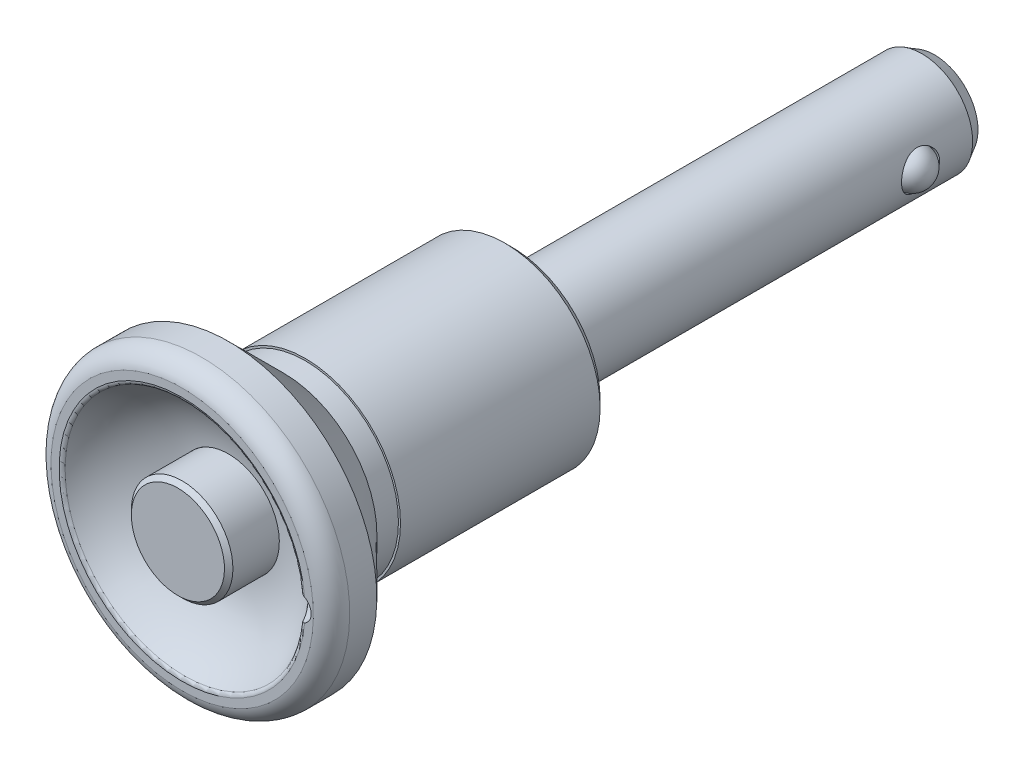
ISO-10303-21;
HEADER;
FILE_DESCRIPTION(('STEP AP214'),'2;1');
FILE_NAME('part.step','',(''),(''),'','','');
FILE_SCHEMA(('AUTOMOTIVE_DESIGN { 1 0 10303 214 1 1 1 1 }'));
ENDSEC;
DATA;
#1=APPLICATION_CONTEXT('core data for automotive mechanical design processes');
#2=APPLICATION_PROTOCOL_DEFINITION('international standard','automotive_design',2000,#1);
#3=PRODUCT_CONTEXT('',#1,'mechanical');
#4=PRODUCT('Part','Part','',(#3));
#5=PRODUCT_RELATED_PRODUCT_CATEGORY('part','',(#4));
#6=PRODUCT_DEFINITION_FORMATION('','',#4);
#7=PRODUCT_DEFINITION_CONTEXT('part definition',#1,'design');
#8=PRODUCT_DEFINITION('design','',#6,#7);
#9=PRODUCT_DEFINITION_SHAPE('','',#8);
#10=(LENGTH_UNIT() NAMED_UNIT(*) SI_UNIT(.MILLI.,.METRE.));
#11=(NAMED_UNIT(*) PLANE_ANGLE_UNIT() SI_UNIT($,.RADIAN.));
#12=(NAMED_UNIT(*) SI_UNIT($,.STERADIAN.) SOLID_ANGLE_UNIT());
#13=UNCERTAINTY_MEASURE_WITH_UNIT(LENGTH_MEASURE(1.E-05),#10,'distance_accuracy_value','');
#14=(GEOMETRIC_REPRESENTATION_CONTEXT(3) GLOBAL_UNCERTAINTY_ASSIGNED_CONTEXT((#13)) GLOBAL_UNIT_ASSIGNED_CONTEXT((#10,
#11,#12)) REPRESENTATION_CONTEXT('',''));
#15=CARTESIAN_POINT('',(0.,0.,0.));
#16=DIRECTION('',(0.,0.,1.));
#17=DIRECTION('',(1.,0.,0.));
#18=AXIS2_PLACEMENT_3D('',#15,#16,#17);
#19=CARTESIAN_POINT('',(0.,0.,-49.9));
#20=DIRECTION('',(0.,0.,-1.));
#21=DIRECTION('',(0.,1.,0.));
#22=AXIS2_PLACEMENT_3D('',#19,#20,#21);
#23=CYLINDRICAL_SURFACE('',#22,6.);
#24=CARTESIAN_POINT('',(-5.56214886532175,2.25,-42.25));
#25=CARTESIAN_POINT('',(-5.5621446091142,2.25000456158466,-42.1284887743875));
#26=CARTESIAN_POINT('',(-5.56617390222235,2.24012396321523,-42.0070076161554));
#27=CARTESIAN_POINT('',(-5.58174238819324,2.20104281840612,-41.7677078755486));
#28=CARTESIAN_POINT('',(-5.59328135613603,2.17184285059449,-41.6498891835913));
#29=CARTESIAN_POINT('',(-5.62238220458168,2.09534486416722,-41.4214369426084));
#30=CARTESIAN_POINT('',(-5.63992964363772,2.04809020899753,-41.3107869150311));
#31=CARTESIAN_POINT('',(-5.67904701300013,1.93697785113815,-41.098942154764));
#32=CARTESIAN_POINT('',(-5.70061815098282,1.87311516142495,-40.9977502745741));
#33=CARTESIAN_POINT('',(-5.74655362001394,1.7271999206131,-40.802664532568));
#34=CARTESIAN_POINT('',(-5.77100012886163,1.64445571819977,-40.7093072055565));
#35=CARTESIAN_POINT('',(-5.81924625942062,1.46459375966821,-40.5374157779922));
#36=CARTESIAN_POINT('',(-5.84304574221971,1.36747294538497,-40.4588848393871));
#37=CARTESIAN_POINT('',(-5.88829310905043,1.15754198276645,-40.3162907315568));
#38=CARTESIAN_POINT('',(-5.90963341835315,1.04431042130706,-40.2528107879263));
#39=CARTESIAN_POINT('',(-5.94657011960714,0.807833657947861,-40.1460232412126));
#40=CARTESIAN_POINT('',(-5.96216850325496,0.684591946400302,-40.102708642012));
#41=CARTESIAN_POINT('',(-5.98528045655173,0.437234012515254,-40.0393631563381));
#42=CARTESIAN_POINT('',(-5.99311372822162,0.313384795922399,-40.0184085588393));
#43=CARTESIAN_POINT('',(-6.0009602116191,0.0636965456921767,-39.9974181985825));
#44=CARTESIAN_POINT('',(-6.00097596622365,-0.0621418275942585,-39.997375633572));
#45=CARTESIAN_POINT('',(-5.9933889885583,-0.305615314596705,-40.0176726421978));
#46=CARTESIAN_POINT('',(-5.9861631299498,-0.423348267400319,-40.0370039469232));
#47=CARTESIAN_POINT('',(-5.96539912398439,-0.653758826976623,-40.0938038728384));
#48=CARTESIAN_POINT('',(-5.95186052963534,-0.766436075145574,-40.1312737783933));
#49=CARTESIAN_POINT('',(-5.91956653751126,-0.985483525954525,-40.2237556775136));
#50=CARTESIAN_POINT('',(-5.90073809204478,-1.09173808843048,-40.2790150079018));
#51=CARTESIAN_POINT('',(-5.85976965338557,-1.29372991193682,-40.4052881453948));
#52=CARTESIAN_POINT('',(-5.83762859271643,-1.38946376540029,-40.4763070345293));
#53=CARTESIAN_POINT('',(-5.79078794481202,-1.57363573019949,-40.6369409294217));
#54=CARTESIAN_POINT('',(-5.76601445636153,-1.6613192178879,-40.727400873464));
#55=CARTESIAN_POINT('',(-5.71773690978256,-1.82055593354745,-40.921889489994));
#56=CARTESIAN_POINT('',(-5.69423317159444,-1.89210511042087,-41.0259215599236));
#57=CARTESIAN_POINT('',(-5.65069055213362,-2.01848417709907,-41.247579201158));
#58=CARTESIAN_POINT('',(-5.63074015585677,-2.07290771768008,-41.3654552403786));
#59=CARTESIAN_POINT('',(-5.59758657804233,-2.16084696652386,-41.6096443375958));
#60=CARTESIAN_POINT('',(-5.58437964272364,-2.19437430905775,-41.7359526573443));
#61=CARTESIAN_POINT('',(-5.56709395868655,-2.23785287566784,-41.9859639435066));
#62=CARTESIAN_POINT('',(-5.56255177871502,-2.24900281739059,-42.109426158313));
#63=CARTESIAN_POINT('',(-5.56179809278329,-2.25086828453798,-42.3565140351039));
#64=CARTESIAN_POINT('',(-5.56558450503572,-2.24158891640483,-42.4801396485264));
#65=CARTESIAN_POINT('',(-5.58059072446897,-2.20394600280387,-42.7178948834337));
#66=CARTESIAN_POINT('',(-5.59144914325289,-2.17650927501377,-42.8321967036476));
#67=CARTESIAN_POINT('',(-5.61894730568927,-2.10449661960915,-43.0545219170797));
#68=CARTESIAN_POINT('',(-5.63558823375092,-2.05991718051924,-43.1625440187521));
#69=CARTESIAN_POINT('',(-5.67354364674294,-1.95300438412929,-43.3737466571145));
#70=CARTESIAN_POINT('',(-5.69500993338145,-1.89006817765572,-43.4765939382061));
#71=CARTESIAN_POINT('',(-5.7399422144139,-1.74886976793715,-43.670693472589));
#72=CARTESIAN_POINT('',(-5.76340893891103,-1.67060195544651,-43.7619414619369));
#73=CARTESIAN_POINT('',(-5.8114956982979,-1.49509101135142,-43.9362525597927));
#74=CARTESIAN_POINT('',(-5.83609454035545,-1.3969595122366,-44.0184301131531));
#75=CARTESIAN_POINT('',(-5.88224812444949,-1.18769620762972,-44.1652575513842));
#76=CARTESIAN_POINT('',(-5.90380285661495,-1.07656435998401,-44.2299073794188));
#77=CARTESIAN_POINT('',(-5.94142478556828,-0.844524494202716,-44.3394190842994));
#78=CARTESIAN_POINT('',(-5.95751072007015,-0.72365164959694,-44.3843486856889));
#79=CARTESIAN_POINT('',(-5.98244155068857,-0.475322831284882,-44.4529846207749));
#80=CARTESIAN_POINT('',(-5.99128984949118,-0.347869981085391,-44.4767009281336));
#81=CARTESIAN_POINT('',(-6.0004261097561,-0.0980033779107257,-44.5011616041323));
#82=CARTESIAN_POINT('',(-6.00118291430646,0.0242711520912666,-44.5031642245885));
#83=CARTESIAN_POINT('',(-5.99527334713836,0.267340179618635,-44.4873772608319));
#84=CARTESIAN_POINT('',(-5.98860787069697,0.388134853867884,-44.4695900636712));
#85=CARTESIAN_POINT('',(-5.96881634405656,0.621822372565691,-44.4156117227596));
#86=CARTESIAN_POINT('',(-5.95585187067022,0.734836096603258,-44.3798801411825));
#87=CARTESIAN_POINT('',(-5.92481675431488,0.953273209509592,-44.2914849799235));
#88=CARTESIAN_POINT('',(-5.90674514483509,1.05869515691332,-44.2388181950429));
#89=CARTESIAN_POINT('',(-5.86635927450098,1.26381026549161,-44.1155290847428));
#90=CARTESIAN_POINT('',(-5.8438986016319,1.36307632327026,-44.0442450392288));
#91=CARTESIAN_POINT('',(-5.79749261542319,1.54862602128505,-43.8867882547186));
#92=CARTESIAN_POINT('',(-5.77354677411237,1.63490500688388,-43.8006102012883));
#93=CARTESIAN_POINT('',(-5.72532194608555,1.7967182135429,-43.6104038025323));
#94=CARTESIAN_POINT('',(-5.70109208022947,1.87144499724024,-43.5056733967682));
#95=CARTESIAN_POINT('',(-5.65647487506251,2.00227064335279,-43.2843761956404));
#96=CARTESIAN_POINT('',(-5.6360879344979,2.05836757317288,-43.1678081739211));
#97=CARTESIAN_POINT('',(-5.60103404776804,2.15198830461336,-42.9205664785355));
#98=CARTESIAN_POINT('',(-5.58665704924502,2.18859004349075,-42.7894984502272));
#99=CARTESIAN_POINT('',(-5.56721991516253,2.23758535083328,-42.5222720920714));
#100=CARTESIAN_POINT('',(-5.56215363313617,2.24999489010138,-42.3861171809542));
#101=CARTESIAN_POINT('',(-5.56214886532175,2.25,-42.25));
#102=B_SPLINE_CURVE_WITH_KNOTS('',3,(#24,#25,#26,#27,#28,#29,#30,#31,#32,#33,#34,#35,#36,#37,
#38,#39,#40,#41,#42,#43,#44,#45,#46,#47,#48,#49,#50,#51,#52,#53,#54,#55,#56,#57,#58,#59,#60,#61,
#62,#63,#64,#65,#66,#67,#68,#69,#70,#71,#72,#73,#74,#75,#76,#77,#78,#79,#80,#81,#82,#83,#84,#85,
#86,#87,#88,#89,#90,#91,#92,#93,#94,#95,#96,#97,#98,#99,#100,#101),.UNSPECIFIED.,.T.,.F.,(4,2,2,
2,2,2,2,2,2,2,2,2,2,2,2,2,2,2,2,2,2,2,2,2,2,2,2,2,2,2,2,2,2,2,2,2,2,2,4),(0.,0.364026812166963,
0.728042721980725,1.09118978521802,1.45444601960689,1.83411978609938,2.2138744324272,
2.60655108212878,2.99909139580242,3.37470027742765,3.75018698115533,4.10709709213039,
4.4640324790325,4.82616196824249,5.1884084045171,5.57185012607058,5.95538801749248,
6.34743888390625,6.73927127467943,7.1094848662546,7.4796059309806,7.83215768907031,
8.18478170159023,8.55062341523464,8.91659922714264,9.30577525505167,9.69495254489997,
10.0827826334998,10.4704302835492,10.8354858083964,11.2004973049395,11.5566041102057,
11.9127783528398,12.2839248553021,12.6552040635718,13.0460789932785,13.436994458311,
13.8450476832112,14.2528314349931),.UNSPECIFIED.);
#103=CARTESIAN_POINT('',(-5.56214886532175,2.25,-42.25));
#104=VERTEX_POINT('',#103);
#105=EDGE_CURVE('E68',#104,#104,#102,.T.);
#106=ORIENTED_EDGE('',*,*,#105,.T.);
#107=EDGE_LOOP('',(#106));
#108=FACE_BOUND('',#107,.T.);
#109=CARTESIAN_POINT('',(0.,0.,-48.4));
#110=DIRECTION('',(0.,0.,-1.));
#111=DIRECTION('',(0.,1.,0.));
#112=AXIS2_PLACEMENT_3D('',#109,#110,#111);
#113=CIRCLE('',#112,6.);
#114=CARTESIAN_POINT('',(0.,6.,-48.4));
#115=VERTEX_POINT('',#114);
#116=EDGE_CURVE('E314',#115,#115,#113,.T.);
#117=ORIENTED_EDGE('',*,*,#116,.F.);
#118=EDGE_LOOP('',(#117));
#119=FACE_BOUND('',#118,.T.);
#120=CARTESIAN_POINT('',(5.56214886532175,2.25,-42.25));
#121=CARTESIAN_POINT('',(5.5621446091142,2.25000456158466,-42.3715112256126));
#122=CARTESIAN_POINT('',(5.56617390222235,2.24012396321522,-42.4929923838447));
#123=CARTESIAN_POINT('',(5.58174238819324,2.20104281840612,-42.7322921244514));
#124=CARTESIAN_POINT('',(5.59328135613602,2.17184285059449,-42.8501108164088));
#125=CARTESIAN_POINT('',(5.62238220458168,2.09534486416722,-43.0785630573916));
#126=CARTESIAN_POINT('',(5.63992964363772,2.04809020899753,-43.189213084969));
#127=CARTESIAN_POINT('',(5.67904701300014,1.93697785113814,-43.401057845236));
#128=CARTESIAN_POINT('',(5.70061815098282,1.87311516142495,-43.5022497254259));
#129=CARTESIAN_POINT('',(5.74655362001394,1.7271999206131,-43.697335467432));
#130=CARTESIAN_POINT('',(5.77100012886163,1.64445571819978,-43.7906927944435));
#131=CARTESIAN_POINT('',(5.81924625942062,1.46459375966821,-43.9625842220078));
#132=CARTESIAN_POINT('',(5.84304574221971,1.36747294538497,-44.0411151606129));
#133=CARTESIAN_POINT('',(5.88829310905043,1.15754198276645,-44.1837092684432));
#134=CARTESIAN_POINT('',(5.90963341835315,1.04431042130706,-44.2471892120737));
#135=CARTESIAN_POINT('',(5.94657011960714,0.807833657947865,-44.3539767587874));
#136=CARTESIAN_POINT('',(5.96216850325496,0.684591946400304,-44.397291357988));
#137=CARTESIAN_POINT('',(5.98528045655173,0.437234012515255,-44.4606368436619));
#138=CARTESIAN_POINT('',(5.99311372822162,0.313384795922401,-44.4815914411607));
#139=CARTESIAN_POINT('',(6.0009602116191,0.0636965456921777,-44.5025818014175));
#140=CARTESIAN_POINT('',(6.00097596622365,-0.0621418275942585,-44.502624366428));
#141=CARTESIAN_POINT('',(5.9933889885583,-0.305615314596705,-44.4823273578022));
#142=CARTESIAN_POINT('',(5.9861631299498,-0.423348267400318,-44.4629960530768));
#143=CARTESIAN_POINT('',(5.96539912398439,-0.653758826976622,-44.4061961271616));
#144=CARTESIAN_POINT('',(5.95186052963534,-0.766436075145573,-44.3687262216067));
#145=CARTESIAN_POINT('',(5.91956653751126,-0.985483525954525,-44.2762443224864));
#146=CARTESIAN_POINT('',(5.90073809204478,-1.09173808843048,-44.2209849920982));
#147=CARTESIAN_POINT('',(5.85976965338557,-1.29372991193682,-44.0947118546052));
#148=CARTESIAN_POINT('',(5.83762859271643,-1.38946376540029,-44.0236929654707));
#149=CARTESIAN_POINT('',(5.79078794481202,-1.5736357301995,-43.8630590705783));
#150=CARTESIAN_POINT('',(5.76601445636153,-1.6613192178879,-43.772599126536));
#151=CARTESIAN_POINT('',(5.71773690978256,-1.82055593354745,-43.578110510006));
#152=CARTESIAN_POINT('',(5.69423317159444,-1.89210511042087,-43.4740784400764));
#153=CARTESIAN_POINT('',(5.65069055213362,-2.01848417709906,-43.252420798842));
#154=CARTESIAN_POINT('',(5.63074015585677,-2.07290771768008,-43.1345447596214));
#155=CARTESIAN_POINT('',(5.59758657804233,-2.16084696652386,-42.8903556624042));
#156=CARTESIAN_POINT('',(5.58437964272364,-2.19437430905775,-42.7640473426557));
#157=CARTESIAN_POINT('',(5.56709395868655,-2.23785287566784,-42.5140360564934));
#158=CARTESIAN_POINT('',(5.56255177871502,-2.24900281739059,-42.3905738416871));
#159=CARTESIAN_POINT('',(5.56179809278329,-2.25086828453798,-42.1434859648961));
#160=CARTESIAN_POINT('',(5.56558450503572,-2.24158891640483,-42.0198603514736));
#161=CARTESIAN_POINT('',(5.58059072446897,-2.20394600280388,-41.7821051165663));
#162=CARTESIAN_POINT('',(5.59144914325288,-2.17650927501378,-41.6678032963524));
#163=CARTESIAN_POINT('',(5.61894730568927,-2.10449661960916,-41.4454780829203));
#164=CARTESIAN_POINT('',(5.63558823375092,-2.05991718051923,-41.337455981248));
#165=CARTESIAN_POINT('',(5.67354364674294,-1.95300438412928,-41.1262533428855));
#166=CARTESIAN_POINT('',(5.69500993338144,-1.89006817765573,-41.023406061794));
#167=CARTESIAN_POINT('',(5.7399422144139,-1.74886976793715,-40.829306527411));
#168=CARTESIAN_POINT('',(5.76340893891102,-1.67060195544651,-40.7380585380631));
#169=CARTESIAN_POINT('',(5.8114956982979,-1.49509101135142,-40.5637474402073));
#170=CARTESIAN_POINT('',(5.83609454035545,-1.39695951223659,-40.4815698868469));
#171=CARTESIAN_POINT('',(5.88224812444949,-1.18769620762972,-40.3347424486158));
#172=CARTESIAN_POINT('',(5.90380285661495,-1.076564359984,-40.2700926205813));
#173=CARTESIAN_POINT('',(5.94142478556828,-0.844524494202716,-40.1605809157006));
#174=CARTESIAN_POINT('',(5.95751072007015,-0.723651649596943,-40.1156513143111));
#175=CARTESIAN_POINT('',(5.98244155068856,-0.475322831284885,-40.0470153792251));
#176=CARTESIAN_POINT('',(5.99128984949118,-0.34786998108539,-40.0232990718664));
#177=CARTESIAN_POINT('',(6.0004261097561,-0.0980033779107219,-39.9988383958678));
#178=CARTESIAN_POINT('',(6.00118291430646,0.0242711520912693,-39.9968357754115));
#179=CARTESIAN_POINT('',(5.99527334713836,0.267340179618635,-40.0126227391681));
#180=CARTESIAN_POINT('',(5.98860787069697,0.388134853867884,-40.0304099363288));
#181=CARTESIAN_POINT('',(5.96881634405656,0.621822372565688,-40.0843882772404));
#182=CARTESIAN_POINT('',(5.95585187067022,0.734836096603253,-40.1201198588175));
#183=CARTESIAN_POINT('',(5.92481675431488,0.953273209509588,-40.2085150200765));
#184=CARTESIAN_POINT('',(5.90674514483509,1.05869515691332,-40.2611818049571));
#185=CARTESIAN_POINT('',(5.86635927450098,1.26381026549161,-40.3844709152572));
#186=CARTESIAN_POINT('',(5.8438986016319,1.36307632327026,-40.4557549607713));
#187=CARTESIAN_POINT('',(5.79749261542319,1.54862602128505,-40.6132117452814));
#188=CARTESIAN_POINT('',(5.77354677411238,1.63490500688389,-40.6993897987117));
#189=CARTESIAN_POINT('',(5.72532194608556,1.7967182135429,-40.8895961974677));
#190=CARTESIAN_POINT('',(5.70109208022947,1.87144499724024,-40.9943266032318));
#191=CARTESIAN_POINT('',(5.6564748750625,2.00227064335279,-41.2156238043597));
#192=CARTESIAN_POINT('',(5.63608793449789,2.05836757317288,-41.3321918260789));
#193=CARTESIAN_POINT('',(5.60103404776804,2.15198830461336,-41.5794335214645));
#194=CARTESIAN_POINT('',(5.58665704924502,2.18859004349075,-41.7105015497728));
#195=CARTESIAN_POINT('',(5.56721991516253,2.23758535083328,-41.9777279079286));
#196=CARTESIAN_POINT('',(5.56215363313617,2.24999489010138,-42.1138828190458));
#197=CARTESIAN_POINT('',(5.56214886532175,2.25,-42.25));
#198=B_SPLINE_CURVE_WITH_KNOTS('',3,(#120,#121,#122,#123,#124,#125,#126,#127,#128,#129,#130,
#131,#132,#133,#134,#135,#136,#137,#138,#139,#140,#141,#142,#143,#144,#145,#146,#147,#148,#149,
#150,#151,#152,#153,#154,#155,#156,#157,#158,#159,#160,#161,#162,#163,#164,#165,#166,#167,#168,
#169,#170,#171,#172,#173,#174,#175,#176,#177,#178,#179,#180,#181,#182,#183,#184,#185,#186,#187,
#188,#189,#190,#191,#192,#193,#194,#195,#196,#197),.UNSPECIFIED.,.T.,.F.,(4,2,2,2,2,2,2,2,2,2,2,
2,2,2,2,2,2,2,2,2,2,2,2,2,2,2,2,2,2,2,2,2,2,2,2,2,2,2,4),(0.,0.364026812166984,
0.728042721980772,1.09118978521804,1.45444601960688,1.83411978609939,2.2138744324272,
2.60655108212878,2.99909139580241,3.37470027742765,3.75018698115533,4.10709709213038,
4.4640324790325,4.82616196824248,5.1884084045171,5.57185012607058,5.95538801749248,
6.34743888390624,6.73927127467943,7.10948486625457,7.47960593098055,7.83215768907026,
8.18478170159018,8.55062341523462,8.91659922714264,9.30577525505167,9.69495254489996,
10.0827826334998,10.4704302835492,10.8354858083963,11.2004973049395,11.5566041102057,
11.9127783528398,12.2839248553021,12.6552040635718,13.0460789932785,13.4369944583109,
13.8450476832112,14.2528314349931),.UNSPECIFIED.);
#199=CARTESIAN_POINT('',(5.56214886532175,2.25,-42.25));
#200=VERTEX_POINT('',#199);
#201=EDGE_CURVE('E292',#200,#200,#198,.T.);
#202=ORIENTED_EDGE('',*,*,#201,.T.);
#203=EDGE_LOOP('',(#202));
#204=FACE_BOUND('',#203,.T.);
#205=CARTESIAN_POINT('',(0.,0.,0.));
#206=DIRECTION('',(0.,0.,1.));
#207=DIRECTION('',(1.,0.,0.));
#208=AXIS2_PLACEMENT_3D('',#205,#206,#207);
#209=CIRCLE('',#208,6.);
#210=CARTESIAN_POINT('',(6.,0.,0.));
#211=VERTEX_POINT('',#210);
#212=EDGE_CURVE('E80',#211,#211,#209,.T.);
#213=ORIENTED_EDGE('',*,*,#212,.F.);
#214=EDGE_LOOP('',(#213));
#215=FACE_BOUND('',#214,.T.);
#216=ADVANCED_FACE('F14',(#108,#119,#204,#215),#23,.T.);
#217=CARTESIAN_POINT('',(0.,0.,-49.9));
#218=DIRECTION('',(0.,0.,-1.));
#219=DIRECTION('',(0.,1.,0.));
#220=AXIS2_PLACEMENT_3D('',#217,#218,#219);
#221=CYLINDRICAL_SURFACE('',#220,2.75);
#222=CARTESIAN_POINT('',(0.,0.,-44.5));
#223=DIRECTION('',(0.,0.,-1.));
#224=DIRECTION('',(0.,1.,0.));
#225=AXIS2_PLACEMENT_3D('',#222,#223,#224);
#226=CIRCLE('',#225,2.75);
#227=CARTESIAN_POINT('',(0.,2.75,-44.5));
#228=VERTEX_POINT('',#227);
#229=EDGE_CURVE('E74',#228,#228,#226,.T.);
#230=ORIENTED_EDGE('',*,*,#229,.F.);
#231=EDGE_LOOP('',(#230));
#232=FACE_BOUND('',#231,.T.);
#233=CARTESIAN_POINT('',(0.,0.,-49.9));
#234=DIRECTION('',(0.,0.,-1.));
#235=DIRECTION('',(0.,1.,0.));
#236=AXIS2_PLACEMENT_3D('',#233,#234,#235);
#237=CIRCLE('',#236,2.75);
#238=CARTESIAN_POINT('',(0.,2.75,-49.9));
#239=VERTEX_POINT('',#238);
#240=EDGE_CURVE('E306',#239,#239,#237,.T.);
#241=ORIENTED_EDGE('',*,*,#240,.T.);
#242=EDGE_LOOP('',(#241));
#243=FACE_BOUND('',#242,.T.);
#244=ADVANCED_FACE('F273',(#232,#243),#221,.F.);
#245=CARTESIAN_POINT('',(2.75,0.,-49.9));
#246=DIRECTION('',(0.,0.,-1.));
#247=DIRECTION('',(0.,1.,0.));
#248=AXIS2_PLACEMENT_3D('',#245,#246,#247);
#249=PLANE('',#248);
#250=CARTESIAN_POINT('',(0.,0.,-49.9));
#251=DIRECTION('',(0.,0.,-1.));
#252=DIRECTION('',(0.,1.,0.));
#253=AXIS2_PLACEMENT_3D('',#250,#251,#252);
#254=CIRCLE('',#253,5.13397459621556);
#255=CARTESIAN_POINT('',(0.,5.13397459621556,-49.9));
#256=VERTEX_POINT('',#255);
#257=EDGE_CURVE('E310',#256,#256,#254,.T.);
#258=ORIENTED_EDGE('',*,*,#257,.T.);
#259=EDGE_LOOP('',(#258));
#260=FACE_BOUND('',#259,.T.);
#261=ORIENTED_EDGE('',*,*,#240,.F.);
#262=EDGE_LOOP('',(#261));
#263=FACE_BOUND('',#262,.T.);
#264=ADVANCED_FACE('F280',(#260,#263),#249,.T.);
#265=CARTESIAN_POINT('',(0.,0.,-49.9));
#266=DIRECTION('',(0.,0.,1.));
#267=DIRECTION('',(0.,-1.,0.));
#268=AXIS2_PLACEMENT_3D('',#265,#266,#267);
#269=CONICAL_SURFACE('',#268,5.13397459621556,0.523598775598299);
#270=ORIENTED_EDGE('',*,*,#116,.T.);
#271=EDGE_LOOP('',(#270));
#272=FACE_BOUND('',#271,.T.);
#273=ORIENTED_EDGE('',*,*,#257,.F.);
#274=EDGE_LOOP('',(#273));
#275=FACE_BOUND('',#274,.T.);
#276=ADVANCED_FACE('F288',(#272,#275),#269,.T.);
#277=CARTESIAN_POINT('',(7.,0.,-42.25));
#278=DIRECTION('',(1.,0.,0.));
#279=DIRECTION('',(0.,1.,0.));
#280=AXIS2_PLACEMENT_3D('',#277,#278,#279);
#281=CYLINDRICAL_SURFACE('',#280,2.25);
#282=CARTESIAN_POINT('',(4.70120856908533,2.25,-42.25));
#283=CARTESIAN_POINT('',(4.70121469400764,2.24999417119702,-42.1304590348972));
#284=CARTESIAN_POINT('',(4.70583400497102,2.24041261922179,-42.0107125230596));
#285=CARTESIAN_POINT('',(4.72369711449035,2.20249080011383,-41.7747180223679));
#286=CARTESIAN_POINT('',(4.73696351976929,2.17410135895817,-41.6584800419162));
#287=CARTESIAN_POINT('',(4.77031963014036,2.09989154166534,-41.4333349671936));
#288=CARTESIAN_POINT('',(4.79038009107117,2.05414577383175,-41.324398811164));
#289=CARTESIAN_POINT('',(4.83501981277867,1.94674472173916,-41.1157771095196));
#290=CARTESIAN_POINT('',(4.85959823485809,1.88509238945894,-41.016089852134));
#291=CARTESIAN_POINT('',(4.91234222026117,1.74321937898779,-40.8220680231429));
#292=CARTESIAN_POINT('',(4.94063496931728,1.66209866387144,-40.7284258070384));
#293=CARTESIAN_POINT('',(4.99657815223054,1.48547872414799,-40.5555585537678));
#294=CARTESIAN_POINT('',(5.02422832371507,1.38997374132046,-40.4763393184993));
#295=CARTESIAN_POINT('',(5.07733633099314,1.18176930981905,-40.3309420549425));
#296=CARTESIAN_POINT('',(5.10262925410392,1.06847133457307,-40.2655553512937));
#297=CARTESIAN_POINT('',(5.14660113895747,0.831192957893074,-40.1550726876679));
#298=CARTESIAN_POINT('',(5.16528324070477,0.707217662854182,-40.1099670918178));
#299=CARTESIAN_POINT('',(5.1930243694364,0.459385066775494,-40.0438746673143));
#300=CARTESIAN_POINT('',(5.20255899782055,0.335901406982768,-40.0216905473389));
#301=CARTESIAN_POINT('',(5.21266651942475,0.0866213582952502,-39.9981895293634));
#302=CARTESIAN_POINT('',(5.21324333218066,-0.0391739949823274,-39.9968635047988));
#303=CARTESIAN_POINT('',(5.20564133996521,-0.280752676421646,-40.0145162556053));
#304=CARTESIAN_POINT('',(5.19803132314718,-0.39665375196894,-40.0321759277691));
#305=CARTESIAN_POINT('',(5.17570524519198,-0.623658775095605,-40.0850210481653));
#306=CARTESIAN_POINT('',(5.16098865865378,-0.734762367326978,-40.1202077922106));
#307=CARTESIAN_POINT('',(5.12557562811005,-0.951074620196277,-40.2075078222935));
#308=CARTESIAN_POINT('',(5.10479112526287,-1.05616705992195,-40.2598718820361));
#309=CARTESIAN_POINT('',(5.05924909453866,-1.25634985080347,-40.3797828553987));
#310=CARTESIAN_POINT('',(5.03449013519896,-1.35143657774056,-40.4473352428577));
#311=CARTESIAN_POINT('',(4.9812692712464,-1.53647964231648,-40.6015757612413));
#312=CARTESIAN_POINT('',(4.95266891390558,-1.6255187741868,-40.689317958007));
#313=CARTESIAN_POINT('',(4.89634671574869,-1.7880335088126,-40.8785052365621));
#314=CARTESIAN_POINT('',(4.8686252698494,-1.86150219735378,-40.9799563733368));
#315=CARTESIAN_POINT('',(4.81616806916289,-1.99339518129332,-41.1984520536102));
#316=CARTESIAN_POINT('',(4.79158303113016,-2.05115292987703,-41.3159383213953));
#317=CARTESIAN_POINT('',(4.75001097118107,-2.14568300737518,-41.5603104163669));
#318=CARTESIAN_POINT('',(4.73301805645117,-2.18247161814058,-41.6871888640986));
#319=CARTESIAN_POINT('',(4.7100473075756,-2.23159308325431,-41.9375319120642));
#320=CARTESIAN_POINT('',(4.70339790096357,-2.24542132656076,-42.0606401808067));
#321=CARTESIAN_POINT('',(4.69994279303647,-2.25264846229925,-42.3075714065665));
#322=CARTESIAN_POINT('',(4.70313324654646,-2.24605533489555,-42.4313940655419));
#323=CARTESIAN_POINT('',(4.71830050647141,-2.21399394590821,-42.6669653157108));
#324=CARTESIAN_POINT('',(4.72963794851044,-2.18989787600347,-42.778947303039));
#325=CARTESIAN_POINT('',(4.75898261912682,-2.12536894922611,-42.9971687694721));
#326=CARTESIAN_POINT('',(4.77699148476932,-2.08493208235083,-43.1034068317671));
#327=CARTESIAN_POINT('',(4.81860535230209,-1.98691927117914,-43.3123309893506));
#328=CARTESIAN_POINT('',(4.8424207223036,-1.92867086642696,-43.414658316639));
#329=CARTESIAN_POINT('',(4.89268495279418,-1.79734114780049,-43.6086003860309));
#330=CARTESIAN_POINT('',(4.91913500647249,-1.72425309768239,-43.7002102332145));
#331=CARTESIAN_POINT('',(4.97451487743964,-1.5576964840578,-43.8785741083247));
#332=CARTESIAN_POINT('',(5.00345675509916,-1.46299589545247,-43.9641786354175));
#333=CARTESIAN_POINT('',(5.05840859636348,-1.25992784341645,-44.11851397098));
#334=CARTESIAN_POINT('',(5.0844182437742,-1.15155890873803,-44.1872429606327));
#335=CARTESIAN_POINT('',(5.13083610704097,-0.923055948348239,-44.3059980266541));
#336=CARTESIAN_POINT('',(5.15121223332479,-0.802859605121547,-44.3559175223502));
#337=CARTESIAN_POINT('',(5.18380508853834,-0.554662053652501,-44.4344361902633));
#338=CARTESIAN_POINT('',(5.19602706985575,-0.426665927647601,-44.4630490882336));
#339=CARTESIAN_POINT('',(5.21029045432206,-0.176736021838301,-44.4963229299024));
#340=CARTESIAN_POINT('',(5.21301888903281,-0.0550554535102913,-44.5026010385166));
#341=CARTESIAN_POINT('',(5.20993078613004,0.187600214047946,-44.495446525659));
#342=CARTESIAN_POINT('',(5.2041159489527,0.308575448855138,-44.4820178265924));
#343=CARTESIAN_POINT('',(5.18496872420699,0.541359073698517,-44.436990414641));
#344=CARTESIAN_POINT('',(5.17194743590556,0.653340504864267,-44.4061426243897));
#345=CARTESIAN_POINT('',(5.13986314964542,0.870473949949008,-44.3280030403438));
#346=CARTESIAN_POINT('',(5.12079904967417,0.975624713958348,-44.2807082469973));
#347=CARTESIAN_POINT('',(5.07736891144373,1.18141977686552,-44.1686191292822));
#348=CARTESIAN_POINT('',(5.05280038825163,1.2816385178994,-44.1031238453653));
#349=CARTESIAN_POINT('',(5.00122306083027,1.47009921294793,-43.957485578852));
#350=CARTESIAN_POINT('',(4.9742132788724,1.5583363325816,-43.877336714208));
#351=CARTESIAN_POINT('',(4.9182708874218,1.72712341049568,-43.6976966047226));
#352=CARTESIAN_POINT('',(4.88934356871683,1.80662459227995,-43.5972140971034));
#353=CARTESIAN_POINT('',(4.83482876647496,1.94782882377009,-43.3835276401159));
#354=CARTESIAN_POINT('',(4.80924325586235,2.00952138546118,-43.270316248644));
#355=CARTESIAN_POINT('',(4.76470338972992,2.11297708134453,-43.0338474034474));
#356=CARTESIAN_POINT('',(4.74574393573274,2.15475554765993,-42.9105977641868));
#357=CARTESIAN_POINT('',(4.72435108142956,2.20105394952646,-42.7212685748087));
#358=CARTESIAN_POINT('',(4.71839681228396,2.21375426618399,-42.6574783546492));
#359=CARTESIAN_POINT('',(4.70903769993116,2.23359624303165,-42.5288695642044));
#360=CARTESIAN_POINT('',(4.70563091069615,2.2407421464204,-42.4640518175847));
#361=CARTESIAN_POINT('',(4.7027842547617,2.24670526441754,-42.3742341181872));
#362=CARTESIAN_POINT('',(4.7021941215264,2.24794009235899,-42.3494079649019));
#363=CARTESIAN_POINT('',(4.70140563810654,2.24958807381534,-42.2997241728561));
#364=CARTESIAN_POINT('',(4.70120729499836,2.25000121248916,-42.2748665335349));
#365=CARTESIAN_POINT('',(4.70120856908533,2.25,-42.25));
#366=B_SPLINE_CURVE_WITH_KNOTS('',3,(#282,#283,#284,#285,#286,#287,#288,#289,#290,#291,#292,
#293,#294,#295,#296,#297,#298,#299,#300,#301,#302,#303,#304,#305,#306,#307,#308,#309,#310,#311,
#312,#313,#314,#315,#316,#317,#318,#319,#320,#321,#322,#323,#324,#325,#326,#327,#328,#329,#330,
#331,#332,#333,#334,#335,#336,#337,#338,#339,#340,#341,#342,#343,#344,#345,#346,#347,#348,#349,
#350,#351,#352,#353,#354,#355,#356,#357,#358,#359,#360,#361,#362,#363,#364,#365),.UNSPECIFIED.,
.T.,.F.,(4,2,2,2,2,2,2,2,2,2,2,2,2,2,2,2,2,2,2,2,2,2,2,2,2,2,2,2,2,2,2,2,2,2,2,2,2,2,2,2,2,4),
(0.,0.358523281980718,0.717987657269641,1.07592402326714,1.43379401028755,1.81338979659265,
2.19313794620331,2.59079710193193,2.98826712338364,3.36372670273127,3.73902199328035,
4.08983186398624,4.4406676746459,4.79687203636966,5.15320497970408,5.53621810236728,
5.91940095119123,6.31693575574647,6.71416146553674,7.08432459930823,7.45434310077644,
7.79811230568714,8.14196592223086,8.50086375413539,8.85992486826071,9.25080120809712,
9.64171965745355,10.0348210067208,10.427668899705,10.7914180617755,11.1550948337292,
11.5041747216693,11.8533183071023,12.2184179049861,12.583664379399,12.9758816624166,
13.3683294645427,13.7604746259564,13.9561801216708,14.1517359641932,14.2263134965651,
14.3008923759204),.UNSPECIFIED.);
#367=CARTESIAN_POINT('',(4.84677342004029,1.91641577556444,-43.4289192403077));
#368=VERTEX_POINT('',#367);
#369=CARTESIAN_POINT('',(4.84677342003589,-1.91641577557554,-43.4289192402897));
#370=VERTEX_POINT('',#369);
#371=EDGE_CURVE('E70',#368,#370,#366,.T.);
#372=ORIENTED_EDGE('',*,*,#371,.F.);
#373=CARTESIAN_POINT('',(5.21189620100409,0.,-44.5));
#374=CARTESIAN_POINT('',(5.21189615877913,0.126284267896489,-44.4999948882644));
#375=CARTESIAN_POINT('',(5.21139467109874,0.25264400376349,-44.4893340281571));
#376=CARTESIAN_POINT('',(5.2093805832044,0.501864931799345,-44.4469613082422));
#377=CARTESIAN_POINT('',(5.20786696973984,0.624722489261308,-44.4152283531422));
#378=CARTESIAN_POINT('',(5.20380519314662,0.863320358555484,-44.3316208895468));
#379=CARTESIAN_POINT('',(5.20125743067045,0.979063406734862,-44.2797541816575));
#380=CARTESIAN_POINT('',(5.19508229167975,1.20015943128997,-44.1573752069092));
#381=CARTESIAN_POINT('',(5.19145518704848,1.30551501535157,-44.0868676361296));
#382=CARTESIAN_POINT('',(5.18303472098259,1.50291352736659,-43.9291996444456));
#383=CARTESIAN_POINT('',(5.17824107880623,1.59495324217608,-43.8420352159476));
#384=CARTESIAN_POINT('',(5.16733442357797,1.76311423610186,-43.653525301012));
#385=CARTESIAN_POINT('',(5.16122100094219,1.83923055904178,-43.5521754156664));
#386=CARTESIAN_POINT('',(5.14734400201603,1.97343552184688,-43.3381336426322));
#387=CARTESIAN_POINT('',(5.13957863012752,2.03150437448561,-43.2254294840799));
#388=CARTESIAN_POINT('',(5.12176723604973,2.1278284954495,-42.9921124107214));
#389=CARTESIAN_POINT('',(5.111724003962,2.16610781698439,-42.8715092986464));
#390=CARTESIAN_POINT('',(5.0933054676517,2.2077406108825,-42.6884429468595));
#391=CARTESIAN_POINT('',(5.08666779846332,2.21896106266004,-42.6275162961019));
#392=CARTESIAN_POINT('',(5.07117135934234,2.23631965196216,-42.505313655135));
#393=CARTESIAN_POINT('',(5.06231462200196,2.24246241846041,-42.444038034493));
#394=CARTESIAN_POINT('',(5.04473959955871,2.24786649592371,-42.3524947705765));
#395=CARTESIAN_POINT('',(5.03817832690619,2.24903385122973,-42.3220839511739));
#396=CARTESIAN_POINT('',(5.02487846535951,2.24972982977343,-42.2856268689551));
#397=CARTESIAN_POINT('',(5.02196282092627,2.24983087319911,-42.278411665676));
#398=CARTESIAN_POINT('',(5.01679668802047,2.24992122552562,-42.2690075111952));
#399=CARTESIAN_POINT('',(5.01524668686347,2.24994100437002,-42.266465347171));
#400=CARTESIAN_POINT('',(5.01258312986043,2.24996347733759,-42.2628773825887));
#401=CARTESIAN_POINT('',(5.01163231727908,2.24996978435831,-42.2617128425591));
#402=CARTESIAN_POINT('',(5.00957474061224,2.24998007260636,-42.2595306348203));
#403=CARTESIAN_POINT('',(5.00846878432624,2.24998406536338,-42.258512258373));
#404=CARTESIAN_POINT('',(5.0067156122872,2.2499883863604,-42.2572404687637));
#405=CARTESIAN_POINT('',(5.00615104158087,2.2499895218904,-42.2568745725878));
#406=CARTESIAN_POINT('',(5.00497729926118,2.2499914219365,-42.2562214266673));
#407=CARTESIAN_POINT('',(5.00436814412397,2.24999218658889,-42.2559341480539));
#408=CARTESIAN_POINT('',(5.00310140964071,2.24999338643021,-42.2554607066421));
#409=CARTESIAN_POINT('',(5.00244330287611,2.24999381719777,-42.2552759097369));
#410=CARTESIAN_POINT('',(5.0011038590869,2.24999436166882,-42.2550386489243));
#411=CARTESIAN_POINT('',(5.00042256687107,2.24999447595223,-42.2549859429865));
#412=CARTESIAN_POINT('',(4.99914424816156,2.24999440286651,-42.2550185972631));
#413=CARTESIAN_POINT('',(4.99854676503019,2.24999424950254,-42.2550883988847));
#414=CARTESIAN_POINT('',(4.99737209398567,2.24999369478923,-42.2553279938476));
#415=CARTESIAN_POINT('',(4.99679493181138,2.24999329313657,-42.2554979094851));
#416=CARTESIAN_POINT('',(4.99546550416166,2.24999202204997,-42.2559985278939));
#417=CARTESIAN_POINT('',(4.99472705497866,2.24999103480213,-42.2563654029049));
#418=CARTESIAN_POINT('',(4.99331619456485,2.24998849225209,-42.2572086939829));
#419=CARTESIAN_POINT('',(4.99264394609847,2.24998693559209,-42.257685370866));
#420=CARTESIAN_POINT('',(4.99079786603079,2.24998155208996,-42.2591607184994));
#421=CARTESIAN_POINT('',(4.98969889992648,2.24997693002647,-42.2602516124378));
#422=CARTESIAN_POINT('',(4.98765562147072,2.24996520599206,-42.2625688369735));
#423=CARTESIAN_POINT('',(4.9867118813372,2.249958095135,-42.2637956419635));
#424=CARTESIAN_POINT('',(4.98193653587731,2.2499128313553,-42.2705312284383));
#425=CARTESIAN_POINT('',(4.97899990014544,2.24985038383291,-42.2766418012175));
#426=CARTESIAN_POINT('',(4.97376920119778,2.24966896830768,-42.2891278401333));
#427=CARTESIAN_POINT('',(4.97148201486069,2.24954942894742,-42.2955053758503));
#428=CARTESIAN_POINT('',(4.96106149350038,2.24881762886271,-42.327105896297));
#429=CARTESIAN_POINT('',(4.95530816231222,2.24778447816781,-42.3531043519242));
#430=CARTESIAN_POINT('',(4.94501184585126,2.24479018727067,-42.4053004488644));
#431=CARTESIAN_POINT('',(4.94047527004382,2.24282427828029,-42.4314984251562));
#432=CARTESIAN_POINT('',(4.92798476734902,2.23550007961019,-42.5104298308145));
#433=CARTESIAN_POINT('',(4.92120435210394,2.22872063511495,-42.5632520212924));
#434=CARTESIAN_POINT('',(4.90891131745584,2.21142389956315,-42.6682645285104));
#435=CARTESIAN_POINT('',(4.90339617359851,2.20091415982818,-42.7204559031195));
#436=CARTESIAN_POINT('',(4.88803764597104,2.1637301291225,-42.8762327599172));
#437=CARTESIAN_POINT('',(4.87942579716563,2.13143364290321,-42.9786677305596));
#438=CARTESIAN_POINT('',(4.86395279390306,2.05263870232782,-43.1776953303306));
#439=CARTESIAN_POINT('',(4.85708717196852,2.00617717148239,-43.2743023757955));
#440=CARTESIAN_POINT('',(4.84463430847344,1.8999869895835,-43.4599495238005));
#441=CARTESIAN_POINT('',(4.83904642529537,1.84026502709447,-43.5489934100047));
#442=CARTESIAN_POINT('',(4.82796886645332,1.69683921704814,-43.7329593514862));
#443=CARTESIAN_POINT('',(4.82267830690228,1.61075316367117,-43.8260495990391));
#444=CARTESIAN_POINT('',(4.81331124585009,1.42411005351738,-43.9965405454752));
#445=CARTESIAN_POINT('',(4.80923548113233,1.32354426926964,-44.0739317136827));
#446=CARTESIAN_POINT('',(4.80219403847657,1.11084101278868,-44.2107437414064));
#447=CARTESIAN_POINT('',(4.79922814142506,0.998705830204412,-44.270168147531));
#448=CARTESIAN_POINT('',(4.79434733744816,0.766047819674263,-44.3693541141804));
#449=CARTESIAN_POINT('',(4.7924323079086,0.64552597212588,-44.4091179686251));
#450=CARTESIAN_POINT('',(4.78962227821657,0.399571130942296,-44.4678412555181));
#451=CARTESIAN_POINT('',(4.78872674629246,0.27414073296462,-44.4868115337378));
#452=CARTESIAN_POINT('',(4.78794106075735,0.0218703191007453,-44.5034420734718));
#453=CARTESIAN_POINT('',(4.78805091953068,-0.104969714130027,-44.5011020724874));
#454=CARTESIAN_POINT('',(4.78927737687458,-0.356418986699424,-44.4751821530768));
#455=CARTESIAN_POINT('',(4.79039368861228,-0.481028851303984,-44.4516082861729));
#456=CARTESIAN_POINT('',(4.79364906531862,-0.724519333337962,-44.3839024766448));
#457=CARTESIAN_POINT('',(4.79578813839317,-0.84339990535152,-44.3397703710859));
#458=CARTESIAN_POINT('',(4.80112512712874,-1.07207309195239,-44.2322025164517));
#459=CARTESIAN_POINT('',(4.80432317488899,-1.18186457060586,-44.1687643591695));
#460=CARTESIAN_POINT('',(4.81184515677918,-1.38922597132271,-44.0244041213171));
#461=CARTESIAN_POINT('',(4.81616903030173,-1.48679655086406,-43.9434829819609));
#462=CARTESIAN_POINT('',(4.82606445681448,-1.66699500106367,-43.7664389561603));
#463=CARTESIAN_POINT('',(4.83163644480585,-1.749617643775,-43.6703107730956));
#464=CARTESIAN_POINT('',(4.84427017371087,-1.89756793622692,-43.465602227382));
#465=CARTESIAN_POINT('',(4.85133233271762,-1.96289072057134,-43.3570183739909));
#466=CARTESIAN_POINT('',(4.86742332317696,-2.07443577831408,-43.1304409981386));
#467=CARTESIAN_POINT('',(4.87645418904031,-2.12063814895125,-43.0124378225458));
#468=CARTESIAN_POINT('',(4.89787609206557,-2.19253624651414,-42.7707327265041));
#469=CARTESIAN_POINT('',(4.9102638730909,-2.2182517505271,-42.6470364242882));
#470=CARTESIAN_POINT('',(4.93489152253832,-2.24079197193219,-42.4621887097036));
#471=CARTESIAN_POINT('',(4.9439209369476,-2.24567525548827,-42.4016395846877));
#472=CARTESIAN_POINT('',(4.96144377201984,-2.24865520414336,-42.3288938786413));
#473=CARTESIAN_POINT('',(4.96488235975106,-2.24907569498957,-42.3157504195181));
#474=CARTESIAN_POINT('',(4.97117438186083,-2.24953233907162,-42.2963421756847));
#475=CARTESIAN_POINT('',(4.97347535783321,-2.24965571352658,-42.2898919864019));
#476=CARTESIAN_POINT('',(4.97872381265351,-2.2498436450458,-42.277231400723));
#477=CARTESIAN_POINT('',(4.98166680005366,-2.24990859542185,-42.2710196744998));
#478=CARTESIAN_POINT('',(4.98649447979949,-2.24995636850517,-42.264083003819));
#479=CARTESIAN_POINT('',(4.98748893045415,-2.24996411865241,-42.2627698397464));
#480=CARTESIAN_POINT('',(4.98964936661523,-2.24997676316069,-42.2602966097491));
#481=CARTESIAN_POINT('',(4.99081420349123,-2.24998167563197,-42.2591356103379));
#482=CARTESIAN_POINT('',(4.99264559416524,-2.24998690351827,-42.2576897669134));
#483=CARTESIAN_POINT('',(4.9932154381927,-2.24998824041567,-42.2572839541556));
#484=CARTESIAN_POINT('',(4.9944037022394,-2.24999050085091,-42.2565481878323));
#485=CARTESIAN_POINT('',(4.99502214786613,-2.24999142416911,-42.2562182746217));
#486=CARTESIAN_POINT('',(4.9963143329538,-2.24999290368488,-42.2556581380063));
#487=CARTESIAN_POINT('',(4.99698872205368,-2.24999345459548,-42.2554293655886));
#488=CARTESIAN_POINT('',(4.99836895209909,-2.24999420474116,-42.2551094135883));
#489=CARTESIAN_POINT('',(4.99907470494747,-2.24999440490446,-42.2550178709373));
#490=CARTESIAN_POINT('',(5.00040115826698,-2.24999446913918,-42.2549888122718));
#491=CARTESIAN_POINT('',(5.00102150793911,-2.24999437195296,-42.2550335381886));
#492=CARTESIAN_POINT('',(5.00224443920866,-2.24999391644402,-42.2552331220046));
#493=CARTESIAN_POINT('',(5.00284699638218,-2.24999355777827,-42.2553881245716));
#494=CARTESIAN_POINT('',(5.00417868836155,-2.24999242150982,-42.2558452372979));
#495=CARTESIAN_POINT('',(5.00489786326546,-2.24999155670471,-42.2561758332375));
#496=CARTESIAN_POINT('',(5.00627531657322,-2.24998931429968,-42.2569451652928));
#497=CARTESIAN_POINT('',(5.00693345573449,-2.24998793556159,-42.2573841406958));
#498=CARTESIAN_POINT('',(5.00870837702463,-2.24998324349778,-42.2587256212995));
#499=CARTESIAN_POINT('',(5.00975965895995,-2.24997927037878,-42.2597134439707));
#500=CARTESIAN_POINT('',(5.0117195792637,-2.24996920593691,-42.2618205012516));
#501=CARTESIAN_POINT('',(5.01262772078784,-2.24996310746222,-42.2629401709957));
#502=CARTESIAN_POINT('',(5.01640763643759,-2.2499311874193,-42.2680200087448));
#503=CARTESIAN_POINT('',(5.01876364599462,-2.24989314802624,-42.2723506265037));
#504=CARTESIAN_POINT('',(5.02299212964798,-2.24978775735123,-42.2812382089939));
#505=CARTESIAN_POINT('',(5.02486105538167,-2.24972020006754,-42.2857965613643));
#506=CARTESIAN_POINT('',(5.03489036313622,-2.24924415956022,-42.3122210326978));
#507=CARTESIAN_POINT('',(5.04042841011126,-2.24850580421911,-42.3350346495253));
#508=CARTESIAN_POINT('',(5.05033017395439,-2.24631053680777,-42.3808965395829));
#509=CARTESIAN_POINT('',(5.05468563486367,-2.24484876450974,-42.4039453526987));
#510=CARTESIAN_POINT('',(5.06660405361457,-2.2393744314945,-42.4732312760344));
#511=CARTESIAN_POINT('',(5.07302100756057,-2.23427272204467,-42.5196160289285));
#512=CARTESIAN_POINT('',(5.08465584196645,-2.2211897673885,-42.6119328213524));
#513=CARTESIAN_POINT('',(5.08987723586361,-2.21321714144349,-42.657865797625));
#514=CARTESIAN_POINT('',(5.10441457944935,-2.18496052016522,-42.7951352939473));
#515=CARTESIAN_POINT('',(5.11257661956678,-2.16035336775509,-42.8857441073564));
#516=CARTESIAN_POINT('',(5.12987991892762,-2.0895877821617,-43.093794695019));
#517=CARTESIAN_POINT('',(5.13839608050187,-2.03893154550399,-43.2097746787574));
#518=CARTESIAN_POINT('',(5.1535975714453,-1.91883883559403,-43.4317326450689));
#519=CARTESIAN_POINT('',(5.16028217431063,-1.84939493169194,-43.5377066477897));
#520=CARTESIAN_POINT('',(5.17224042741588,-1.69367708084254,-43.7365753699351));
#521=CARTESIAN_POINT('',(5.17751400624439,-1.60740228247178,-43.8294694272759));
#522=CARTESIAN_POINT('',(5.18684741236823,-1.42044938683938,-43.9995115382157));
#523=CARTESIAN_POINT('',(5.19090710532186,-1.31976969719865,-44.0766578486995));
#524=CARTESIAN_POINT('',(5.19792144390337,-1.10680030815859,-44.2130331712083));
#525=CARTESIAN_POINT('',(5.20087527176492,-0.994502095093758,-44.2722489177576));
#526=CARTESIAN_POINT('',(5.20572992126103,-0.761612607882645,-44.3709456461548));
#527=CARTESIAN_POINT('',(5.20763177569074,-0.641029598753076,-44.4104459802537));
#528=CARTESIAN_POINT('',(5.2099837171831,-0.43325534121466,-44.4596153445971));
#529=CARTESIAN_POINT('',(5.21070118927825,-0.34731672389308,-44.4747381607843));
#530=CARTESIAN_POINT('',(5.2116574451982,-0.174264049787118,-44.4949322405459));
#531=CARTESIAN_POINT('',(5.21189623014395,-0.0871499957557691,-44.5000035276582));
#532=CARTESIAN_POINT('',(5.21189620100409,0.,-44.5));
#533=B_SPLINE_CURVE_WITH_KNOTS('',3,(#373,#374,#375,#376,#377,#378,#379,#380,#381,#382,#383,
#384,#385,#386,#387,#388,#389,#390,#391,#392,#393,#394,#395,#396,#397,#398,#399,#400,#401,#402,
#403,#404,#405,#406,#407,#408,#409,#410,#411,#412,#413,#414,#415,#416,#417,#418,#419,#420,#421,
#422,#423,#424,#425,#426,#427,#428,#429,#430,#431,#432,#433,#434,#435,#436,#437,#438,#439,#440,
#441,#442,#443,#444,#445,#446,#447,#448,#449,#450,#451,#452,#453,#454,#455,#456,#457,#458,#459,
#460,#461,#462,#463,#464,#465,#466,#467,#468,#469,#470,#471,#472,#473,#474,#475,#476,#477,#478,
#479,#480,#481,#482,#483,#484,#485,#486,#487,#488,#489,#490,#491,#492,#493,#494,#495,#496,#497,
#498,#499,#500,#501,#502,#503,#504,#505,#506,#507,#508,#509,#510,#511,#512,#513,#514,#515,#516,
#517,#518,#519,#520,#521,#522,#523,#524,#525,#526,#527,#528,#529,#530,#531,#532),.UNSPECIFIED.,
.T.,.F.,(4,2,2,2,2,2,2,2,2,2,2,2,2,2,2,2,2,2,2,2,2,2,2,2,2,2,2,2,2,2,2,2,2,2,2,2,2,2,2,2,2,2,2,
2,2,2,2,2,2,2,2,2,2,2,2,2,2,2,2,2,2,2,2,2,2,2,2,2,2,2,2,2,2,2,2,2,2,2,2,4),(0.,
0.378536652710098,0.757452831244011,1.13622234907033,1.5148965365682,1.89366194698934,
2.27254507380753,2.65184215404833,3.03067712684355,3.2173684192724,3.40388932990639,
3.49689225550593,3.52015002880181,3.52905034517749,3.53355316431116,3.53803335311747,
3.54004707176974,3.542060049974,3.54409924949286,3.54613470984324,3.54792997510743,
3.54972743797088,3.55218703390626,3.55465253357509,3.55927190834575,3.56390794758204,
3.5840452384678,3.60438842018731,3.68399607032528,3.76401517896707,3.92481563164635,
4.08529241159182,4.4073088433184,4.7284929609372,5.0495154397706,5.42838148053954,
5.80747684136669,6.18649732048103,6.56547356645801,6.9442520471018,7.32303519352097,
7.70171042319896,8.08038865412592,8.45911414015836,8.8378192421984,9.21665653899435,
9.59560026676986,9.97493745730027,10.3539080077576,10.5376762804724,10.5783848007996,
10.5989488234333,10.6193733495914,10.624307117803,10.6292090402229,10.6313034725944,
10.6333990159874,10.6355237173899,10.6376427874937,10.6394980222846,10.6413556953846,
10.6437168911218,10.6460833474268,10.650386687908,10.6547046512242,10.6693813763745,
10.6841622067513,10.7542437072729,10.8248025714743,10.9658951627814,11.1065676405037,
11.3885103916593,11.7672030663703,12.1460457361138,12.5249075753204,12.9038113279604,
13.2829947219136,13.6618051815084,13.9230376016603,14.1842694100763),.UNSPECIFIED.);
#534=EDGE_CURVE('E32',#370,#368,#533,.T.);
#535=ORIENTED_EDGE('',*,*,#534,.F.);
#536=EDGE_LOOP('',(#372,#535));
#537=FACE_BOUND('',#536,.T.);
#538=ORIENTED_EDGE('',*,*,#201,.F.);
#539=EDGE_LOOP('',(#538));
#540=FACE_BOUND('',#539,.T.);
#541=ADVANCED_FACE('F71',(#537,#540),#281,.F.);
#542=CARTESIAN_POINT('',(-4.70120856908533,2.25,-42.25));
#543=CARTESIAN_POINT('',(-4.70121469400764,2.24999417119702,-42.3695409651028));
#544=CARTESIAN_POINT('',(-4.70583400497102,2.24041261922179,-42.4892874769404));
#545=CARTESIAN_POINT('',(-4.72369711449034,2.20249080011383,-42.7252819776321));
#546=CARTESIAN_POINT('',(-4.73696351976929,2.17410135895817,-42.8415199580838));
#547=CARTESIAN_POINT('',(-4.77031963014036,2.09989154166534,-43.0666650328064));
#548=CARTESIAN_POINT('',(-4.79038009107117,2.05414577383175,-43.1756011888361));
#549=CARTESIAN_POINT('',(-4.83501981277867,1.94674472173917,-43.3842228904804));
#550=CARTESIAN_POINT('',(-4.85959823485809,1.88509238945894,-43.483910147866));
#551=CARTESIAN_POINT('',(-4.91234222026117,1.74321937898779,-43.6779319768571));
#552=CARTESIAN_POINT('',(-4.94063496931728,1.66209866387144,-43.7715741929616));
#553=CARTESIAN_POINT('',(-4.99657815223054,1.48547872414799,-43.9444414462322));
#554=CARTESIAN_POINT('',(-5.02422832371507,1.38997374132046,-44.0236606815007));
#555=CARTESIAN_POINT('',(-5.07733633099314,1.18176930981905,-44.1690579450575));
#556=CARTESIAN_POINT('',(-5.10262925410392,1.06847133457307,-44.2344446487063));
#557=CARTESIAN_POINT('',(-5.14660113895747,0.831192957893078,-44.3449273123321));
#558=CARTESIAN_POINT('',(-5.16528324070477,0.707217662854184,-44.3900329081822));
#559=CARTESIAN_POINT('',(-5.1930243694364,0.459385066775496,-44.4561253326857));
#560=CARTESIAN_POINT('',(-5.20255899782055,0.335901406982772,-44.4783094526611));
#561=CARTESIAN_POINT('',(-5.21266651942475,0.0866213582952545,-44.5018104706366));
#562=CARTESIAN_POINT('',(-5.21324333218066,-0.0391739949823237,-44.5031364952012));
#563=CARTESIAN_POINT('',(-5.20564133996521,-0.280752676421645,-44.4854837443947));
#564=CARTESIAN_POINT('',(-5.19803132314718,-0.39665375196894,-44.4678240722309));
#565=CARTESIAN_POINT('',(-5.17570524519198,-0.623658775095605,-44.4149789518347));
#566=CARTESIAN_POINT('',(-5.16098865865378,-0.734762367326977,-44.3797922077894));
#567=CARTESIAN_POINT('',(-5.12557562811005,-0.951074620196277,-44.2924921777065));
#568=CARTESIAN_POINT('',(-5.10479112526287,-1.05616705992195,-44.2401281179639));
#569=CARTESIAN_POINT('',(-5.05924909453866,-1.25634985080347,-44.1202171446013));
#570=CARTESIAN_POINT('',(-5.03449013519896,-1.35143657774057,-44.0526647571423));
#571=CARTESIAN_POINT('',(-4.9812692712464,-1.53647964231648,-43.8984242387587));
#572=CARTESIAN_POINT('',(-4.95266891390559,-1.62551877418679,-43.810682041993));
#573=CARTESIAN_POINT('',(-4.8963467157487,-1.78803350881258,-43.621494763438));
#574=CARTESIAN_POINT('',(-4.86862526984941,-1.86150219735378,-43.5200436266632));
#575=CARTESIAN_POINT('',(-4.8161680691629,-1.99339518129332,-43.3015479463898));
#576=CARTESIAN_POINT('',(-4.79158303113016,-2.05115292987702,-43.1840616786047));
#577=CARTESIAN_POINT('',(-4.75001097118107,-2.14568300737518,-42.9396895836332));
#578=CARTESIAN_POINT('',(-4.73301805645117,-2.18247161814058,-42.8128111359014));
#579=CARTESIAN_POINT('',(-4.7100473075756,-2.23159308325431,-42.5624680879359));
#580=CARTESIAN_POINT('',(-4.70339790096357,-2.24542132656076,-42.4393598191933));
#581=CARTESIAN_POINT('',(-4.69994279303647,-2.25264846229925,-42.1924285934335));
#582=CARTESIAN_POINT('',(-4.70313324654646,-2.24605533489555,-42.0686059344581));
#583=CARTESIAN_POINT('',(-4.71830050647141,-2.21399394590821,-41.8330346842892));
#584=CARTESIAN_POINT('',(-4.72963794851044,-2.18989787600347,-41.721052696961));
#585=CARTESIAN_POINT('',(-4.75898261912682,-2.12536894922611,-41.5028312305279));
#586=CARTESIAN_POINT('',(-4.77699148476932,-2.08493208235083,-41.3965931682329));
#587=CARTESIAN_POINT('',(-4.81860535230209,-1.98691927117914,-41.1876690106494));
#588=CARTESIAN_POINT('',(-4.8424207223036,-1.92867086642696,-41.085341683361));
#589=CARTESIAN_POINT('',(-4.89268495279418,-1.79734114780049,-40.8913996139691));
#590=CARTESIAN_POINT('',(-4.91913500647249,-1.72425309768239,-40.7997897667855));
#591=CARTESIAN_POINT('',(-4.97451487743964,-1.5576964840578,-40.6214258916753));
#592=CARTESIAN_POINT('',(-5.00345675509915,-1.46299589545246,-40.5358213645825));
#593=CARTESIAN_POINT('',(-5.05840859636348,-1.25992784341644,-40.38148602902));
#594=CARTESIAN_POINT('',(-5.0844182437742,-1.15155890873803,-40.3127570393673));
#595=CARTESIAN_POINT('',(-5.13083610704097,-0.923055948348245,-40.1940019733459));
#596=CARTESIAN_POINT('',(-5.15121223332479,-0.802859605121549,-40.1440824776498));
#597=CARTESIAN_POINT('',(-5.18380508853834,-0.554662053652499,-40.0655638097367));
#598=CARTESIAN_POINT('',(-5.19602706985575,-0.4266659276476,-40.0369509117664));
#599=CARTESIAN_POINT('',(-5.21029045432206,-0.1767360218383,-40.0036770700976));
#600=CARTESIAN_POINT('',(-5.21301888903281,-0.055055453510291,-39.9973989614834));
#601=CARTESIAN_POINT('',(-5.20993078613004,0.187600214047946,-40.004553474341));
#602=CARTESIAN_POINT('',(-5.2041159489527,0.308575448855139,-40.0179821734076));
#603=CARTESIAN_POINT('',(-5.18496872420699,0.541359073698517,-40.063009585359));
#604=CARTESIAN_POINT('',(-5.17194743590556,0.653340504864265,-40.0938573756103));
#605=CARTESIAN_POINT('',(-5.13986314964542,0.870473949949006,-40.1719969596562));
#606=CARTESIAN_POINT('',(-5.12079904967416,0.975624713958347,-40.2192917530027));
#607=CARTESIAN_POINT('',(-5.07736891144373,1.18141977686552,-40.3313808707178));
#608=CARTESIAN_POINT('',(-5.05280038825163,1.28163851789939,-40.3968761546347));
#609=CARTESIAN_POINT('',(-5.00122306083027,1.47009921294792,-40.542514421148));
#610=CARTESIAN_POINT('',(-4.9742132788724,1.5583363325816,-40.622663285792));
#611=CARTESIAN_POINT('',(-4.9182708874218,1.72712341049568,-40.8023033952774));
#612=CARTESIAN_POINT('',(-4.88934356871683,1.80662459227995,-40.9027859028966));
#613=CARTESIAN_POINT('',(-4.83482876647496,1.94782882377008,-41.1164723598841));
#614=CARTESIAN_POINT('',(-4.80924325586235,2.00952138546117,-41.229683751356));
#615=CARTESIAN_POINT('',(-4.76470338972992,2.11297708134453,-41.4661525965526));
#616=CARTESIAN_POINT('',(-4.74574393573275,2.15475554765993,-41.5894022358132));
#617=CARTESIAN_POINT('',(-4.72435108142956,2.20105394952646,-41.7787314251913));
#618=CARTESIAN_POINT('',(-4.71839681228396,2.21375426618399,-41.8425216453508));
#619=CARTESIAN_POINT('',(-4.70903769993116,2.23359624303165,-41.9711304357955));
#620=CARTESIAN_POINT('',(-4.70563091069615,2.2407421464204,-42.0359481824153));
#621=CARTESIAN_POINT('',(-4.7027842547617,2.24670526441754,-42.1257658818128));
#622=CARTESIAN_POINT('',(-4.7021941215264,2.24794009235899,-42.1505920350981));
#623=CARTESIAN_POINT('',(-4.70140563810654,2.24958807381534,-42.2002758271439));
#624=CARTESIAN_POINT('',(-4.70120729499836,2.25000121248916,-42.2251334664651));
#625=CARTESIAN_POINT('',(-4.70120856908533,2.25,-42.25));
#626=B_SPLINE_CURVE_WITH_KNOTS('',3,(#542,#543,#544,#545,#546,#547,#548,#549,#550,#551,#552,
#553,#554,#555,#556,#557,#558,#559,#560,#561,#562,#563,#564,#565,#566,#567,#568,#569,#570,#571,
#572,#573,#574,#575,#576,#577,#578,#579,#580,#581,#582,#583,#584,#585,#586,#587,#588,#589,#590,
#591,#592,#593,#594,#595,#596,#597,#598,#599,#600,#601,#602,#603,#604,#605,#606,#607,#608,#609,
#610,#611,#612,#613,#614,#615,#616,#617,#618,#619,#620,#621,#622,#623,#624,#625),.UNSPECIFIED.,
.T.,.F.,(4,2,2,2,2,2,2,2,2,2,2,2,2,2,2,2,2,2,2,2,2,2,2,2,2,2,2,2,2,2,2,2,2,2,2,2,2,2,2,2,2,4),
(0.,0.358523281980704,0.717987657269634,1.07592402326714,1.43379401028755,1.81338979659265,
2.19313794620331,2.59079710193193,2.98826712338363,3.36372670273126,3.73902199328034,
4.08983186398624,4.4406676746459,4.79687203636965,5.15320497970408,5.53621810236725,
5.91940095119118,6.31693575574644,6.71416146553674,7.08432459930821,7.45434310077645,
7.79811230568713,8.14196592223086,8.50086375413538,8.85992486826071,9.25080120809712,
9.64171965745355,10.0348210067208,10.427668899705,10.7914180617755,11.1550948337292,
11.5041747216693,11.8533183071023,12.2184179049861,12.583664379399,12.9758816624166,
13.3683294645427,13.7604746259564,13.9561801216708,14.1517359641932,14.2263134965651,
14.3008923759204),.UNSPECIFIED.);
#627=CARTESIAN_POINT('',(-4.84677342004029,-1.91641577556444,-43.4289192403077));
#628=VERTEX_POINT('',#627);
#629=CARTESIAN_POINT('',(-4.8467734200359,1.91641577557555,-43.4289192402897));
#630=VERTEX_POINT('',#629);
#631=EDGE_CURVE('E77',#628,#630,#626,.T.);
#632=ORIENTED_EDGE('',*,*,#631,.F.);
#633=CARTESIAN_POINT('',(-5.21189620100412,0.,-44.5));
#634=CARTESIAN_POINT('',(-5.21189615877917,-0.126284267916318,-44.4999948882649));
#635=CARTESIAN_POINT('',(-5.21139467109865,-0.252644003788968,-44.4893340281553));
#636=CARTESIAN_POINT('',(-5.20938058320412,-0.501864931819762,-44.4469613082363));
#637=CARTESIAN_POINT('',(-5.20786696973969,-0.624722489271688,-44.4152283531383));
#638=CARTESIAN_POINT('',(-5.20380519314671,-0.863320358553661,-44.3316208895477));
#639=CARTESIAN_POINT('',(-5.20125743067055,-0.979063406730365,-44.2797541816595));
#640=CARTESIAN_POINT('',(-5.19508229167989,-1.20015943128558,-44.157375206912));
#641=CARTESIAN_POINT('',(-5.1914551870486,-1.30551501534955,-44.0868676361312));
#642=CARTESIAN_POINT('',(-5.1830347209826,-1.50291352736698,-43.9291996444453));
#643=CARTESIAN_POINT('',(-5.17824107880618,-1.59495324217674,-43.842035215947));
#644=CARTESIAN_POINT('',(-5.16733442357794,-1.76311423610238,-43.6535253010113));
#645=CARTESIAN_POINT('',(-5.16122100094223,-1.83923055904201,-43.552175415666));
#646=CARTESIAN_POINT('',(-5.14734400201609,-1.97343552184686,-43.3381336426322));
#647=CARTESIAN_POINT('',(-5.13957863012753,-2.03150437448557,-43.22542948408));
#648=CARTESIAN_POINT('',(-5.12176723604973,-2.12782849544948,-42.9921124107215));
#649=CARTESIAN_POINT('',(-5.11172400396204,-2.16610781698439,-42.8715092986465));
#650=CARTESIAN_POINT('',(-5.09330546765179,-2.2077406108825,-42.6884429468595));
#651=CARTESIAN_POINT('',(-5.08666779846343,-2.21896106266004,-42.6275162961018));
#652=CARTESIAN_POINT('',(-5.07117135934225,-2.23631965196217,-42.5053136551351));
#653=CARTESIAN_POINT('',(-5.06231462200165,-2.24246241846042,-42.4440380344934));
#654=CARTESIAN_POINT('',(-5.04473959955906,-2.2478664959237,-42.3524947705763));
#655=CARTESIAN_POINT('',(-5.03817832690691,-2.24903385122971,-42.3220839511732));
#656=CARTESIAN_POINT('',(-5.02487846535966,-2.24972982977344,-42.2856268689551));
#657=CARTESIAN_POINT('',(-5.02196282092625,-2.24983087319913,-42.2784116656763));
#658=CARTESIAN_POINT('',(-5.01679668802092,-2.24992122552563,-42.2690075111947));
#659=CARTESIAN_POINT('',(-5.01524668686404,-2.24994100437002,-42.2664653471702));
#660=CARTESIAN_POINT('',(-5.01258312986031,-2.24996347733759,-42.2628773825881));
#661=CARTESIAN_POINT('',(-5.01163231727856,-2.24996978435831,-42.2617128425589));
#662=CARTESIAN_POINT('',(-5.00957474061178,-2.24998007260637,-42.2595306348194));
#663=CARTESIAN_POINT('',(-5.00846878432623,-2.24998406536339,-42.2585122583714));
#664=CARTESIAN_POINT('',(-5.0067156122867,-2.2499883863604,-42.2572404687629));
#665=CARTESIAN_POINT('',(-5.0061510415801,-2.2499895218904,-42.2568745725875));
#666=CARTESIAN_POINT('',(-5.00497729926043,-2.2499914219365,-42.2562214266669));
#667=CARTESIAN_POINT('',(-5.00436814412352,-2.24999218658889,-42.2559341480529));
#668=CARTESIAN_POINT('',(-5.0031014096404,-2.24999338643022,-42.2554607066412));
#669=CARTESIAN_POINT('',(-5.00244330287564,-2.24999381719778,-42.2552759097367));
#670=CARTESIAN_POINT('',(-5.00110385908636,-2.24999436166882,-42.2550386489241));
#671=CARTESIAN_POINT('',(-5.00042256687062,-2.24999447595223,-42.2549859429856));
#672=CARTESIAN_POINT('',(-4.99914424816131,-2.24999440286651,-42.2550185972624));
#673=CARTESIAN_POINT('',(-4.99854676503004,-2.24999424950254,-42.2550883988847));
#674=CARTESIAN_POINT('',(-4.99737209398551,-2.24999369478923,-42.2553279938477));
#675=CARTESIAN_POINT('',(-4.99679493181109,-2.24999329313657,-42.2554979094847));
#676=CARTESIAN_POINT('',(-4.9954655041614,-2.24999202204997,-42.2559985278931));
#677=CARTESIAN_POINT('',(-4.99472705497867,-2.24999103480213,-42.2563654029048));
#678=CARTESIAN_POINT('',(-4.99331619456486,-2.24998849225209,-42.257208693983));
#679=CARTESIAN_POINT('',(-4.99264394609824,-2.24998693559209,-42.2576853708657));
#680=CARTESIAN_POINT('',(-4.99079786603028,-2.24998155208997,-42.2591607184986));
#681=CARTESIAN_POINT('',(-4.98969889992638,-2.24997693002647,-42.2602516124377));
#682=CARTESIAN_POINT('',(-4.98765562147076,-2.24996520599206,-42.2625688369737));
#683=CARTESIAN_POINT('',(-4.98671188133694,-2.249958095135,-42.2637956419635));
#684=CARTESIAN_POINT('',(-4.98193653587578,-2.2499128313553,-42.270531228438));
#685=CARTESIAN_POINT('',(-4.97899990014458,-2.2498503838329,-42.2766418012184));
#686=CARTESIAN_POINT('',(-4.97376920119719,-2.24966896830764,-42.2891278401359));
#687=CARTESIAN_POINT('',(-4.97148201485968,-2.24954942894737,-42.2955053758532));
#688=CARTESIAN_POINT('',(-4.96106149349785,-2.24881762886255,-42.3271058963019));
#689=CARTESIAN_POINT('',(-4.9553081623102,-2.24778447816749,-42.3531043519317));
#690=CARTESIAN_POINT('',(-4.94501184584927,-2.24479018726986,-42.4053004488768));
#691=CARTESIAN_POINT('',(-4.94047527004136,-2.24282427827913,-42.4314984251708));
#692=CARTESIAN_POINT('',(-4.92798476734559,-2.23550007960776,-42.5104298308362));
#693=CARTESIAN_POINT('',(-4.92120435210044,-2.22872063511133,-42.563252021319));
#694=CARTESIAN_POINT('',(-4.90891131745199,-2.2114238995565,-42.6682645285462));
#695=CARTESIAN_POINT('',(-4.90339617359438,-2.20091415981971,-42.7204559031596));
#696=CARTESIAN_POINT('',(-4.88803764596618,-2.16373012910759,-42.8762327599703));
#697=CARTESIAN_POINT('',(-4.87942579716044,-2.13143364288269,-42.9786677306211));
#698=CARTESIAN_POINT('',(-4.86395279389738,-2.05263870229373,-43.1776953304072));
#699=CARTESIAN_POINT('',(-4.85708717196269,-2.00617717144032,-43.2743023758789));
#700=CARTESIAN_POINT('',(-4.84463430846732,-1.89998698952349,-43.4599495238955));
#701=CARTESIAN_POINT('',(-4.83904642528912,-1.84026502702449,-43.5489934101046));
#702=CARTESIAN_POINT('',(-4.82796886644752,-1.69683921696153,-43.7329593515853));
#703=CARTESIAN_POINT('',(-4.82267830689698,-1.61075316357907,-43.8260495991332));
#704=CARTESIAN_POINT('',(-4.81331124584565,-1.42411005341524,-43.9965405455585));
#705=CARTESIAN_POINT('',(-4.80923548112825,-1.32354426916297,-44.0739317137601));
#706=CARTESIAN_POINT('',(-4.80219403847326,-1.11084101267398,-44.2107437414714));
#707=CARTESIAN_POINT('',(-4.79922814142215,-0.998705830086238,-44.2701681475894));
#708=CARTESIAN_POINT('',(-4.79434733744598,-0.766047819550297,-44.3693541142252));
#709=CARTESIAN_POINT('',(-4.79243230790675,-0.645525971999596,-44.4091179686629));
#710=CARTESIAN_POINT('',(-4.78962227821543,-0.399571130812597,-44.4678412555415));
#711=CARTESIAN_POINT('',(-4.78872674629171,-0.27414073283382,-44.4868115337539));
#712=CARTESIAN_POINT('',(-4.78794106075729,-0.0218703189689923,-44.5034420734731));
#713=CARTESIAN_POINT('',(-4.78805091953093,0.104969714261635,-44.5011020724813));
#714=CARTESIAN_POINT('',(-4.78927737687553,0.356418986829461,-44.475182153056));
#715=CARTESIAN_POINT('',(-4.79039368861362,0.481028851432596,-44.4516082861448));
#716=CARTESIAN_POINT('',(-4.79364906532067,0.724519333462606,-44.3839024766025));
#717=CARTESIAN_POINT('',(-4.79578813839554,0.843399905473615,-44.3397703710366));
#718=CARTESIAN_POINT('',(-4.80112512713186,1.07207309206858,-44.2322025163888));
#719=CARTESIAN_POINT('',(-4.80432317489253,1.18186457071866,-44.1687643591));
#720=CARTESIAN_POINT('',(-4.81184515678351,1.38922597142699,-44.0244041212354));
#721=CARTESIAN_POINT('',(-4.81616903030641,1.48679655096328,-43.9434829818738));
#722=CARTESIAN_POINT('',(-4.82606445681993,1.66699500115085,-43.7664389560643));
#723=CARTESIAN_POINT('',(-4.83163644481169,1.74961764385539,-43.6703107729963));
#724=CARTESIAN_POINT('',(-4.8442701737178,1.89756793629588,-43.4656022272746));
#725=CARTESIAN_POINT('',(-4.85133233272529,1.96289072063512,-43.3570183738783));
#726=CARTESIAN_POINT('',(-4.86742332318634,2.07443577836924,-43.1304409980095));
#727=CARTESIAN_POINT('',(-4.87645418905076,2.12063814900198,-43.012437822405));
#728=CARTESIAN_POINT('',(-4.89787609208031,2.19253624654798,-42.7707327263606));
#729=CARTESIAN_POINT('',(-4.91026387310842,2.21825175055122,-42.6470364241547));
#730=CARTESIAN_POINT('',(-4.93489152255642,2.24079197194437,-42.4621887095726));
#731=CARTESIAN_POINT('',(-4.94392093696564,2.24567525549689,-42.4016395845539));
#732=CARTESIAN_POINT('',(-4.96144377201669,2.24865520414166,-42.3288938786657));
#733=CARTESIAN_POINT('',(-4.96488235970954,2.24907569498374,-42.3157504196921));
#734=CARTESIAN_POINT('',(-4.97117438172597,2.24953233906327,-42.2963421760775));
#735=CARTESIAN_POINT('',(-4.97347535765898,2.24965571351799,-42.2898919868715));
#736=CARTESIAN_POINT('',(-4.97872381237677,2.24984364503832,-42.277231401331));
#737=CARTESIAN_POINT('',(-4.9816667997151,2.2499085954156,-42.2710196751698));
#738=CARTESIAN_POINT('',(-4.98649447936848,2.24995636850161,-42.2640830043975));
#739=CARTESIAN_POINT('',(-4.98748893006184,2.2499641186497,-42.2627698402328));
#740=CARTESIAN_POINT('',(-4.98964936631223,2.24997676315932,-42.2602966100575));
#741=CARTESIAN_POINT('',(-4.99081420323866,2.2499816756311,-42.2591356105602));
#742=CARTESIAN_POINT('',(-4.99264559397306,2.24998690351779,-42.2576897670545));
#743=CARTESIAN_POINT('',(-4.99321543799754,2.24998824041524,-42.2572839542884));
#744=CARTESIAN_POINT('',(-4.99440370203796,2.24999050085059,-42.2565481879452));
#745=CARTESIAN_POINT('',(-4.99502214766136,2.24999142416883,-42.256218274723));
#746=CARTESIAN_POINT('',(-4.99631433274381,2.24999290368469,-42.255658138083));
#747=CARTESIAN_POINT('',(-4.99698872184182,2.24999345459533,-42.2554293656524));
#748=CARTESIAN_POINT('',(-4.99836895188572,2.24999420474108,-42.2551094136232));
#749=CARTESIAN_POINT('',(-4.99907470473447,2.24999440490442,-42.2550178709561));
#750=CARTESIAN_POINT('',(-5.00040115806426,2.2499944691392,-42.2549888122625));
#751=CARTESIAN_POINT('',(-5.00102150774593,2.249994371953,-42.2550335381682));
#752=CARTESIAN_POINT('',(-5.00224443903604,2.24999391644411,-42.2552331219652));
#753=CARTESIAN_POINT('',(-5.00284699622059,2.24999355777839,-42.2553881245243));
#754=CARTESIAN_POINT('',(-5.00417868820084,2.24999242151,-42.2558452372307));
#755=CARTESIAN_POINT('',(-5.00489786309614,2.24999155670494,-42.2561758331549));
#756=CARTESIAN_POINT('',(-5.00627531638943,2.24998931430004,-42.256945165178));
#757=CARTESIAN_POINT('',(-5.00693345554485,2.24998793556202,-42.257384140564));
#758=CARTESIAN_POINT('',(-5.00870837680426,2.24998324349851,-42.2587256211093));
#759=CARTESIAN_POINT('',(-5.00975965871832,2.24997927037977,-42.2597134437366));
#760=CARTESIAN_POINT('',(-5.01171957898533,2.24996920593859,-42.2618205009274));
#761=CARTESIAN_POINT('',(-5.012627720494,2.24996310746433,-42.2629401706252));
#762=CARTESIAN_POINT('',(-5.01640763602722,2.24993118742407,-42.2680200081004));
#763=CARTESIAN_POINT('',(-5.01876364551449,2.24989314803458,-42.2723506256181));
#764=CARTESIAN_POINT('',(-5.02299212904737,2.24978775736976,-42.2812382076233));
#765=CARTESIAN_POINT('',(-5.02486105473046,2.24972020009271,-42.2857965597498));
#766=CARTESIAN_POINT('',(-5.03489036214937,2.24924415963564,-42.3122210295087));
#767=CARTESIAN_POINT('',(-5.04042840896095,2.24850580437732,-42.3350346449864));
#768=CARTESIAN_POINT('',(-5.05033017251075,2.24631053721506,-42.3808965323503));
#769=CARTESIAN_POINT('',(-5.05468563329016,2.24484876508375,-42.4039453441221));
#770=CARTESIAN_POINT('',(-5.06660405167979,2.23937443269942,-42.4732312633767));
#771=CARTESIAN_POINT('',(-5.07302100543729,2.23427272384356,-42.5196160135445));
#772=CARTESIAN_POINT('',(-5.08465583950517,2.22118977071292,-42.6119328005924));
#773=CARTESIAN_POINT('',(-5.08987723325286,2.21321714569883,-42.6578657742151));
#774=CARTESIAN_POINT('',(-5.10441457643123,2.18496052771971,-42.7951352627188));
#775=CARTESIAN_POINT('',(-5.11257661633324,2.16035337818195,-42.8857440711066));
#776=CARTESIAN_POINT('',(-5.12987991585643,2.08958779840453,-43.093794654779));
#777=CARTESIAN_POINT('',(-5.13839607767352,2.03893156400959,-43.2097746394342));
#778=CARTESIAN_POINT('',(-5.15359756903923,1.91883885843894,-43.4317326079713));
#779=CARTESIAN_POINT('',(-5.16028217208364,1.84939495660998,-43.5377066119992));
#780=CARTESIAN_POINT('',(-5.17224042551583,1.69367710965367,-43.7365753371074));
#781=CARTESIAN_POINT('',(-5.17751400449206,1.60740231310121,-43.8294693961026));
#782=CARTESIAN_POINT('',(-5.18684741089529,1.42044942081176,-43.9995115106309));
#783=CARTESIAN_POINT('',(-5.19090710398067,1.31976973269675,-44.0766578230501));
#784=CARTESIAN_POINT('',(-5.19792144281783,1.10680034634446,-44.2130331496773));
#785=CARTESIAN_POINT('',(-5.20087527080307,0.994502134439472,-44.2722488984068));
#786=CARTESIAN_POINT('',(-5.20572992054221,0.761612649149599,-44.3709456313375));
#787=CARTESIAN_POINT('',(-5.20763177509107,0.641029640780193,-44.4104459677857));
#788=CARTESIAN_POINT('',(-5.20998371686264,0.433255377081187,-44.4596153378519));
#789=CARTESIAN_POINT('',(-5.21070118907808,0.347316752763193,-44.4747381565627));
#790=CARTESIAN_POINT('',(-5.21165744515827,0.174264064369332,-44.4949322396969));
#791=CARTESIAN_POINT('',(-5.21189623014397,0.0871500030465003,-44.5000035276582));
#792=CARTESIAN_POINT('',(-5.21189620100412,0.,-44.5));
#793=B_SPLINE_CURVE_WITH_KNOTS('',3,(#633,#634,#635,#636,#637,#638,#639,#640,#641,#642,#643,
#644,#645,#646,#647,#648,#649,#650,#651,#652,#653,#654,#655,#656,#657,#658,#659,#660,#661,#662,
#663,#664,#665,#666,#667,#668,#669,#670,#671,#672,#673,#674,#675,#676,#677,#678,#679,#680,#681,
#682,#683,#684,#685,#686,#687,#688,#689,#690,#691,#692,#693,#694,#695,#696,#697,#698,#699,#700,
#701,#702,#703,#704,#705,#706,#707,#708,#709,#710,#711,#712,#713,#714,#715,#716,#717,#718,#719,
#720,#721,#722,#723,#724,#725,#726,#727,#728,#729,#730,#731,#732,#733,#734,#735,#736,#737,#738,
#739,#740,#741,#742,#743,#744,#745,#746,#747,#748,#749,#750,#751,#752,#753,#754,#755,#756,#757,
#758,#759,#760,#761,#762,#763,#764,#765,#766,#767,#768,#769,#770,#771,#772,#773,#774,#775,#776,
#777,#778,#779,#780,#781,#782,#783,#784,#785,#786,#787,#788,#789,#790,#791,#792),.UNSPECIFIED.,
.T.,.F.,(4,2,2,2,2,2,2,2,2,2,2,2,2,2,2,2,2,2,2,2,2,2,2,2,2,2,2,2,2,2,2,2,2,2,2,2,2,2,2,2,2,2,2,
2,2,2,2,2,2,2,2,2,2,2,2,2,2,2,2,2,2,2,2,2,2,2,2,2,2,2,2,2,2,2,2,2,2,2,2,4),(0.,
0.378536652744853,0.757452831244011,1.13622234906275,1.5148965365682,1.89366194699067,
2.27254507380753,2.6518421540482,3.03067712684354,3.21736841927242,3.40388932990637,
3.49689225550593,3.52015002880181,3.5290503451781,3.53355316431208,3.53803335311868,
3.54004707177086,3.54206004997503,3.54409924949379,3.54613470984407,3.54792997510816,
3.54972743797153,3.55218703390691,3.55465253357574,3.55927190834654,3.56390794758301,
3.58404523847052,3.60438842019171,3.68399607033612,3.76401517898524,3.92481563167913,
4.08529241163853,4.40730884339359,4.7284929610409,5.04951543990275,5.42838148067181,
5.807476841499,6.1864973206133,6.56547356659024,6.94425204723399,7.32303519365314,
7.70171042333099,8.08038865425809,8.45911414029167,8.8378192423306,9.21665653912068,
9.59560026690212,9.97493745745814,10.35390800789,10.5376762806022,10.5783848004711,
10.5989488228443,10.6193733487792,10.6243071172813,10.629209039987,10.6313034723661,
10.6333990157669,10.6355237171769,10.6376427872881,10.6394980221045,10.6413556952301,
10.6437168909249,10.6460833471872,10.6503866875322,10.6547046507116,10.6693813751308,
10.6841622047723,10.7542437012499,10.8248025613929,10.965895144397,11.1065676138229,
11.3885103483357,11.7672030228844,12.1460456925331,12.5249075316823,12.903811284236,
13.2829946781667,13.6618051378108,13.9230375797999,14.1842694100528),.UNSPECIFIED.);
#794=EDGE_CURVE('E24',#630,#628,#793,.T.);
#795=ORIENTED_EDGE('',*,*,#794,.F.);
#796=EDGE_LOOP('',(#632,#795));
#797=FACE_BOUND('',#796,.T.);
#798=ORIENTED_EDGE('',*,*,#105,.F.);
#799=EDGE_LOOP('',(#798));
#800=FACE_BOUND('',#799,.T.);
#801=ADVANCED_FACE('F126',(#797,#800),#281,.F.);
#802=CARTESIAN_POINT('',(5.,0.,-42.26));
#803=DIRECTION('',(0.,0.,-1.));
#804=DIRECTION('',(-1.,0.,0.));
#805=AXIS2_PLACEMENT_3D('',#802,#803,#804);
#806=SPHERICAL_SURFACE('',#805,2.25);
#807=CARTESIAN_POINT('',(5.21189620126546,0.,-40.0199999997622));
#808=CARTESIAN_POINT('',(5.21189163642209,0.121338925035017,-40.02000411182));
#809=CARTESIAN_POINT('',(5.2076139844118,0.242857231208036,-40.0294966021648));
#810=CARTESIAN_POINT('',(5.19090741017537,0.482539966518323,-40.0672715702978));
#811=CARTESIAN_POINT('',(5.17845986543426,0.600696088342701,-40.0955969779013));
#812=CARTESIAN_POINT('',(5.1466904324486,0.829939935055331,-40.1702805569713));
#813=CARTESIAN_POINT('',(5.12738173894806,0.941040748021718,-40.2166041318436));
#814=CARTESIAN_POINT('',(5.08381907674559,1.15343434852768,-40.3261394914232));
#815=CARTESIAN_POINT('',(5.05956701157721,1.25473088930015,-40.3893447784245));
#816=CARTESIAN_POINT('',(5.00801077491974,1.44699626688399,-40.5325850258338));
#817=CARTESIAN_POINT('',(4.98065616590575,1.53772422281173,-40.6129251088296));
#818=CARTESIAN_POINT('',(4.92611533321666,1.70439337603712,-40.7877829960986));
#819=CARTESIAN_POINT('',(4.89892915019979,1.78033112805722,-40.8823040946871));
#820=CARTESIAN_POINT('',(4.84704848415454,1.91715059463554,-41.0854207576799));
#821=CARTESIAN_POINT('',(4.82241983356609,1.97767503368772,-41.1942743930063));
#822=CARTESIAN_POINT('',(4.77915011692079,2.08007095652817,-41.4215326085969));
#823=CARTESIAN_POINT('',(4.76050830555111,2.12194476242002,-41.5399359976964));
#824=CARTESIAN_POINT('',(4.73166063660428,2.18551118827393,-41.7809246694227));
#825=CARTESIAN_POINT('',(4.72132121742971,2.20752406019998,-41.9034092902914));
#826=CARTESIAN_POINT('',(4.70980240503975,2.23199790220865,-42.1507319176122));
#827=CARTESIAN_POINT('',(4.70862129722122,2.23446253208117,-42.2755694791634));
#828=CARTESIAN_POINT('',(4.71545534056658,2.2199990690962,-42.5202861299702));
#829=CARTESIAN_POINT('',(4.72321070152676,2.20361883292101,-42.6402054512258));
#830=CARTESIAN_POINT('',(4.74661601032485,2.15273630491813,-42.8753276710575));
#831=CARTESIAN_POINT('',(4.7622662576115,2.1182333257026,-42.9905303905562));
#832=CARTESIAN_POINT('',(4.79986123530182,2.0316059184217,-43.213839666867));
#833=CARTESIAN_POINT('',(4.82184455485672,1.97937309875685,-43.3218975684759));
#834=CARTESIAN_POINT('',(4.86971823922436,1.8584724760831,-43.5274387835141));
#835=CARTESIAN_POINT('',(4.89560926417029,1.78980189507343,-43.6249203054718));
#836=CARTESIAN_POINT('',(4.94944507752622,1.63515914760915,-43.8098090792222));
#837=CARTESIAN_POINT('',(4.97742849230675,1.54872116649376,-43.8968159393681));
#838=CARTESIAN_POINT('',(5.03173130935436,1.36197773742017,-44.0550564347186));
#839=CARTESIAN_POINT('',(5.05805060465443,1.26167139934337,-44.1262890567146));
#840=CARTESIAN_POINT('',(5.10641059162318,1.04899451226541,-44.2516606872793));
#841=CARTESIAN_POINT('',(5.12842162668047,0.936548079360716,-44.3056827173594));
#842=CARTESIAN_POINT('',(5.16558012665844,0.703261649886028,-44.3945788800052));
#843=CARTESIAN_POINT('',(5.1807287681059,0.582423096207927,-44.4294562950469));
#844=CARTESIAN_POINT('',(5.20223004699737,0.339328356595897,-44.478450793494));
#845=CARTESIAN_POINT('',(5.20881254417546,0.217201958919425,-44.4931110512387));
#846=CARTESIAN_POINT('',(5.21326238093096,-0.0279870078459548,-44.5030536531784));
#847=CARTESIAN_POINT('',(5.21113094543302,-0.151049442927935,-44.4983387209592));
#848=CARTESIAN_POINT('',(5.19851852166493,-0.391769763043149,-44.4699802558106));
#849=CARTESIAN_POINT('',(5.18822187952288,-0.509486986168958,-44.4467545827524));
#850=CARTESIAN_POINT('',(5.16052533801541,-0.739063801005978,-44.382479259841));
#851=CARTESIAN_POINT('',(5.14312517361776,-0.850923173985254,-44.3414289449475));
#852=CARTESIAN_POINT('',(5.10268202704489,-1.0671187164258,-44.2419066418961));
#853=CARTESIAN_POINT('',(5.0795754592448,-1.17135165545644,-44.1832366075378));
#854=CARTESIAN_POINT('',(5.030112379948,-1.3682663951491,-44.0500245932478));
#855=CARTESIAN_POINT('',(5.00375528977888,-1.46094613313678,-43.9754797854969));
#856=CARTESIAN_POINT('',(4.9495839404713,-1.63526034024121,-43.8096912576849));
#857=CARTESIAN_POINT('',(4.92174978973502,-1.71646814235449,-43.7180049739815));
#858=CARTESIAN_POINT('',(4.86838227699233,-1.86246496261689,-43.5217731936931));
#859=CARTESIAN_POINT('',(4.84284911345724,-1.92725256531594,-43.4172265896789));
#860=CARTESIAN_POINT('',(4.79669638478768,-2.03943512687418,-43.1969230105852));
#861=CARTESIAN_POINT('',(4.77612351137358,-2.08666691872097,-43.0810729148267));
#862=CARTESIAN_POINT('',(4.74260951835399,-2.16176450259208,-42.8422134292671));
#863=CARTESIAN_POINT('',(4.72966686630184,-2.18963418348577,-42.7192054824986));
#864=CARTESIAN_POINT('',(4.7132011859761,-2.22485231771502,-42.4730475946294));
#865=CARTESIAN_POINT('',(4.70943528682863,-2.2327301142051,-42.349989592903));
#866=CARTESIAN_POINT('',(4.71105360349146,-2.22931393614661,-42.1042094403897));
#867=CARTESIAN_POINT('',(4.71643681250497,-2.21802207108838,-41.9814872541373));
#868=CARTESIAN_POINT('',(4.73553106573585,-2.17694686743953,-41.7423253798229));
#869=CARTESIAN_POINT('',(4.74907919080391,-2.14752503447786,-41.6258101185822));
#870=CARTESIAN_POINT('',(4.78286866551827,-2.07117359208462,-41.3996969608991));
#871=CARTESIAN_POINT('',(4.8031107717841,-2.02424200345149,-41.290099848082));
#872=CARTESIAN_POINT('',(4.84858393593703,-1.91279217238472,-41.0785166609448));
#873=CARTESIAN_POINT('',(4.8739054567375,-1.84794555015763,-40.9767231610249));
#874=CARTESIAN_POINT('',(4.92658545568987,-1.70252285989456,-40.785674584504));
#875=CARTESIAN_POINT('',(4.95394408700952,-1.62194560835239,-40.6964204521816));
#876=CARTESIAN_POINT('',(5.00860588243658,-1.44449392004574,-40.5303202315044));
#877=CARTESIAN_POINT('',(5.03588776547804,-1.34723945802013,-40.4538724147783));
#878=CARTESIAN_POINT('',(5.08671740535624,-1.14039246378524,-40.3182407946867));
#879=CARTESIAN_POINT('',(5.11026338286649,-1.03079409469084,-40.2590652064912));
#880=CARTESIAN_POINT('',(5.1509406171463,-0.803092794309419,-40.1598822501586));
#881=CARTESIAN_POINT('',(5.16811585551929,-0.685055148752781,-40.1197429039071));
#882=CARTESIAN_POINT('',(5.19441814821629,-0.443367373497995,-40.0591475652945));
#883=CARTESIAN_POINT('',(5.20356524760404,-0.319732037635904,-40.0386425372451));
#884=CARTESIAN_POINT('',(5.20945501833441,-0.162817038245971,-40.0254557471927));
#885=CARTESIAN_POINT('',(5.21036898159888,-0.130297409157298,-40.0234111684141));
#886=CARTESIAN_POINT('',(5.21159018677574,-0.0651895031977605,-40.0206827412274));
#887=CARTESIAN_POINT('',(5.21189742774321,-0.0326012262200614,-40.0199988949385));
#888=CARTESIAN_POINT('',(5.21189620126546,0.,-40.0199999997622));
#889=B_SPLINE_CURVE_WITH_KNOTS('',3,(#807,#808,#809,#810,#811,#812,#813,#814,#815,#816,#817,
#818,#819,#820,#821,#822,#823,#824,#825,#826,#827,#828,#829,#830,#831,#832,#833,#834,#835,#836,
#837,#838,#839,#840,#841,#842,#843,#844,#845,#846,#847,#848,#849,#850,#851,#852,#853,#854,#855,
#856,#857,#858,#859,#860,#861,#862,#863,#864,#865,#866,#867,#868,#869,#870,#871,#872,#873,#874,
#875,#876,#877,#878,#879,#880,#881,#882,#883,#884,#885,#886,#887,#888),.UNSPECIFIED.,.T.,.F.,(4,
2,2,2,2,2,2,2,2,2,2,2,2,2,2,2,2,2,2,2,2,2,2,2,2,2,2,2,2,2,2,2,2,2,2,2,2,2,2,2,4),(0.,
0.363888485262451,0.728609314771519,1.09263250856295,1.45651579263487,1.82751957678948,
2.19860968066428,2.5776471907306,2.95663749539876,3.32940141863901,3.70209555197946,
4.06422276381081,4.42636371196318,4.79075972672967,5.15521736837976,5.53084652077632,
5.90649979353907,6.28465440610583,6.66274416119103,7.0304637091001,7.39813156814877,
7.7577270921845,8.11733603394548,8.48114873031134,8.8450262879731,9.22007983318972,
9.59516569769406,9.97365532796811,10.3520689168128,10.7203531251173,11.0885968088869,
11.4497253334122,11.8108946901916,12.1791822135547,12.5474974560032,12.9257184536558,
13.3041190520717,13.6798563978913,14.0546528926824,14.1524219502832,14.2501911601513),.UNSPECIFIED.);
#890=EDGE_CURVE('E66',#370,#368,#889,.T.);
#891=ORIENTED_EDGE('',*,*,#890,.F.);
#892=ORIENTED_EDGE('',*,*,#534,.T.);
#893=EDGE_LOOP('',(#891,#892));
#894=FACE_BOUND('',#893,.T.);
#895=ADVANCED_FACE('F64',(#894),#806,.T.);
#896=CARTESIAN_POINT('',(-5.,0.,-42.26));
#897=DIRECTION('',(0.,0.,1.));
#898=DIRECTION('',(1.,0.,0.));
#899=AXIS2_PLACEMENT_3D('',#896,#897,#898);
#900=SPHERICAL_SURFACE('',#899,2.25);
#901=CARTESIAN_POINT('',(-5.21189620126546,0.,-40.0199999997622));
#902=CARTESIAN_POINT('',(-5.21189163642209,-0.121338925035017,-40.02000411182));
#903=CARTESIAN_POINT('',(-5.2076139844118,-0.242857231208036,-40.0294966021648));
#904=CARTESIAN_POINT('',(-5.19090741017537,-0.482539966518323,-40.0672715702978));
#905=CARTESIAN_POINT('',(-5.17845986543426,-0.600696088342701,-40.0955969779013));
#906=CARTESIAN_POINT('',(-5.1466904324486,-0.829939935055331,-40.1702805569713));
#907=CARTESIAN_POINT('',(-5.12738173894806,-0.941040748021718,-40.2166041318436));
#908=CARTESIAN_POINT('',(-5.08381907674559,-1.15343434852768,-40.3261394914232));
#909=CARTESIAN_POINT('',(-5.05956701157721,-1.25473088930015,-40.3893447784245));
#910=CARTESIAN_POINT('',(-5.00801077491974,-1.44699626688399,-40.5325850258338));
#911=CARTESIAN_POINT('',(-4.98065616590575,-1.53772422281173,-40.6129251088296));
#912=CARTESIAN_POINT('',(-4.92611533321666,-1.70439337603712,-40.7877829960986));
#913=CARTESIAN_POINT('',(-4.89892915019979,-1.78033112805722,-40.8823040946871));
#914=CARTESIAN_POINT('',(-4.84704848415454,-1.91715059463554,-41.0854207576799));
#915=CARTESIAN_POINT('',(-4.82241983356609,-1.97767503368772,-41.1942743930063));
#916=CARTESIAN_POINT('',(-4.77915011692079,-2.08007095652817,-41.4215326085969));
#917=CARTESIAN_POINT('',(-4.76050830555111,-2.12194476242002,-41.5399359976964));
#918=CARTESIAN_POINT('',(-4.73166063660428,-2.18551118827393,-41.7809246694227));
#919=CARTESIAN_POINT('',(-4.72132121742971,-2.20752406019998,-41.9034092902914));
#920=CARTESIAN_POINT('',(-4.70980240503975,-2.23199790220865,-42.1507319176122));
#921=CARTESIAN_POINT('',(-4.70862129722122,-2.23446253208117,-42.2755694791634));
#922=CARTESIAN_POINT('',(-4.71545534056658,-2.2199990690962,-42.5202861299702));
#923=CARTESIAN_POINT('',(-4.72321070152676,-2.20361883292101,-42.6402054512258));
#924=CARTESIAN_POINT('',(-4.74661601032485,-2.15273630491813,-42.8753276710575));
#925=CARTESIAN_POINT('',(-4.7622662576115,-2.1182333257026,-42.9905303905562));
#926=CARTESIAN_POINT('',(-4.79986123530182,-2.0316059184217,-43.213839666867));
#927=CARTESIAN_POINT('',(-4.82184455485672,-1.97937309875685,-43.3218975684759));
#928=CARTESIAN_POINT('',(-4.86971823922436,-1.8584724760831,-43.5274387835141));
#929=CARTESIAN_POINT('',(-4.89560926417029,-1.78980189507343,-43.6249203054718));
#930=CARTESIAN_POINT('',(-4.94944507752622,-1.63515914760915,-43.8098090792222));
#931=CARTESIAN_POINT('',(-4.97742849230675,-1.54872116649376,-43.8968159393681));
#932=CARTESIAN_POINT('',(-5.03173130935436,-1.36197773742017,-44.0550564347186));
#933=CARTESIAN_POINT('',(-5.05805060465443,-1.26167139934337,-44.1262890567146));
#934=CARTESIAN_POINT('',(-5.10641059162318,-1.04899451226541,-44.2516606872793));
#935=CARTESIAN_POINT('',(-5.12842162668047,-0.936548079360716,-44.3056827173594));
#936=CARTESIAN_POINT('',(-5.16558012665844,-0.703261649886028,-44.3945788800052));
#937=CARTESIAN_POINT('',(-5.1807287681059,-0.582423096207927,-44.4294562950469));
#938=CARTESIAN_POINT('',(-5.20223004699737,-0.339328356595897,-44.478450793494));
#939=CARTESIAN_POINT('',(-5.20881254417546,-0.217201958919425,-44.4931110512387));
#940=CARTESIAN_POINT('',(-5.21326238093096,0.0279870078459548,-44.5030536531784));
#941=CARTESIAN_POINT('',(-5.21113094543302,0.151049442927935,-44.4983387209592));
#942=CARTESIAN_POINT('',(-5.19851852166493,0.391769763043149,-44.4699802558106));
#943=CARTESIAN_POINT('',(-5.18822187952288,0.509486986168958,-44.4467545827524));
#944=CARTESIAN_POINT('',(-5.16052533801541,0.739063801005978,-44.382479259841));
#945=CARTESIAN_POINT('',(-5.14312517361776,0.850923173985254,-44.3414289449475));
#946=CARTESIAN_POINT('',(-5.10268202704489,1.0671187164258,-44.2419066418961));
#947=CARTESIAN_POINT('',(-5.0795754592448,1.17135165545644,-44.1832366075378));
#948=CARTESIAN_POINT('',(-5.030112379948,1.3682663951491,-44.0500245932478));
#949=CARTESIAN_POINT('',(-5.00375528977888,1.46094613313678,-43.9754797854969));
#950=CARTESIAN_POINT('',(-4.9495839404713,1.63526034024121,-43.8096912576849));
#951=CARTESIAN_POINT('',(-4.92174978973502,1.71646814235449,-43.7180049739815));
#952=CARTESIAN_POINT('',(-4.86838227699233,1.86246496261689,-43.5217731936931));
#953=CARTESIAN_POINT('',(-4.84284911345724,1.92725256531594,-43.4172265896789));
#954=CARTESIAN_POINT('',(-4.79669638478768,2.03943512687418,-43.1969230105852));
#955=CARTESIAN_POINT('',(-4.77612351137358,2.08666691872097,-43.0810729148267));
#956=CARTESIAN_POINT('',(-4.74260951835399,2.16176450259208,-42.8422134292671));
#957=CARTESIAN_POINT('',(-4.72966686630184,2.18963418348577,-42.7192054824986));
#958=CARTESIAN_POINT('',(-4.7132011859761,2.22485231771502,-42.4730475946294));
#959=CARTESIAN_POINT('',(-4.70943528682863,2.2327301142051,-42.349989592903));
#960=CARTESIAN_POINT('',(-4.71105360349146,2.22931393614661,-42.1042094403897));
#961=CARTESIAN_POINT('',(-4.71643681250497,2.21802207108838,-41.9814872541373));
#962=CARTESIAN_POINT('',(-4.73553106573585,2.17694686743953,-41.7423253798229));
#963=CARTESIAN_POINT('',(-4.74907919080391,2.14752503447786,-41.6258101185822));
#964=CARTESIAN_POINT('',(-4.78286866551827,2.07117359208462,-41.3996969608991));
#965=CARTESIAN_POINT('',(-4.8031107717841,2.02424200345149,-41.290099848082));
#966=CARTESIAN_POINT('',(-4.84858393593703,1.91279217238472,-41.0785166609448));
#967=CARTESIAN_POINT('',(-4.8739054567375,1.84794555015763,-40.9767231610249));
#968=CARTESIAN_POINT('',(-4.92658545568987,1.70252285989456,-40.785674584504));
#969=CARTESIAN_POINT('',(-4.95394408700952,1.62194560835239,-40.6964204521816));
#970=CARTESIAN_POINT('',(-5.00860588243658,1.44449392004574,-40.5303202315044));
#971=CARTESIAN_POINT('',(-5.03588776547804,1.34723945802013,-40.4538724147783));
#972=CARTESIAN_POINT('',(-5.08671740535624,1.14039246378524,-40.3182407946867));
#973=CARTESIAN_POINT('',(-5.11026338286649,1.03079409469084,-40.2590652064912));
#974=CARTESIAN_POINT('',(-5.1509406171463,0.803092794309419,-40.1598822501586));
#975=CARTESIAN_POINT('',(-5.16811585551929,0.685055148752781,-40.1197429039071));
#976=CARTESIAN_POINT('',(-5.19441814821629,0.443367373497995,-40.0591475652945));
#977=CARTESIAN_POINT('',(-5.20356524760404,0.319732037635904,-40.0386425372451));
#978=CARTESIAN_POINT('',(-5.20945501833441,0.162817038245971,-40.0254557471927));
#979=CARTESIAN_POINT('',(-5.21036898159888,0.130297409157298,-40.0234111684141));
#980=CARTESIAN_POINT('',(-5.21159018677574,0.0651895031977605,-40.0206827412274));
#981=CARTESIAN_POINT('',(-5.21189742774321,0.0326012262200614,-40.0199988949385));
#982=CARTESIAN_POINT('',(-5.21189620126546,0.,-40.0199999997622));
#983=B_SPLINE_CURVE_WITH_KNOTS('',3,(#901,#902,#903,#904,#905,#906,#907,#908,#909,#910,#911,
#912,#913,#914,#915,#916,#917,#918,#919,#920,#921,#922,#923,#924,#925,#926,#927,#928,#929,#930,
#931,#932,#933,#934,#935,#936,#937,#938,#939,#940,#941,#942,#943,#944,#945,#946,#947,#948,#949,
#950,#951,#952,#953,#954,#955,#956,#957,#958,#959,#960,#961,#962,#963,#964,#965,#966,#967,#968,
#969,#970,#971,#972,#973,#974,#975,#976,#977,#978,#979,#980,#981,#982),.UNSPECIFIED.,.T.,.F.,(4,
2,2,2,2,2,2,2,2,2,2,2,2,2,2,2,2,2,2,2,2,2,2,2,2,2,2,2,2,2,2,2,2,2,2,2,2,2,2,2,4),(0.,
0.363888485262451,0.728609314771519,1.09263250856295,1.45651579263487,1.82751957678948,
2.19860968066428,2.5776471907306,2.95663749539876,3.32940141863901,3.70209555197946,
4.06422276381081,4.42636371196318,4.79075972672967,5.15521736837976,5.53084652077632,
5.90649979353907,6.28465440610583,6.66274416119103,7.0304637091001,7.39813156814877,
7.7577270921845,8.11733603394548,8.48114873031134,8.8450262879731,9.22007983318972,
9.59516569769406,9.97365532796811,10.3520689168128,10.7203531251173,11.0885968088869,
11.4497253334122,11.8108946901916,12.1791822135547,12.5474974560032,12.9257184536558,
13.3041190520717,13.6798563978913,14.0546528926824,14.1524219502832,14.2501911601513),.UNSPECIFIED.);
#984=EDGE_CURVE('E9',#630,#628,#983,.T.);
#985=ORIENTED_EDGE('',*,*,#984,.F.);
#986=ORIENTED_EDGE('',*,*,#794,.T.);
#987=EDGE_LOOP('',(#985,#986));
#988=FACE_BOUND('',#987,.T.);
#989=ADVANCED_FACE('F102',(#988),#900,.T.);
#990=CARTESIAN_POINT('',(0.,0.,31.7055795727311));
#991=DIRECTION('',(0.,0.,1.));
#992=DIRECTION('',(0.,-1.,0.));
#993=AXIS2_PLACEMENT_3D('',#990,#991,#992);
#994=CYLINDRICAL_SURFACE('',#993,5.21189620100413);
#995=ORIENTED_EDGE('',*,*,#984,.T.);
#996=ORIENTED_EDGE('',*,*,#631,.T.);
#997=EDGE_LOOP('',(#995,#996));
#998=FACE_BOUND('',#997,.T.);
#999=ADVANCED_FACE('F98',(#998),#994,.T.);
#1000=ORIENTED_EDGE('',*,*,#890,.T.);
#1001=ORIENTED_EDGE('',*,*,#371,.T.);
#1002=EDGE_LOOP('',(#1000,#1001));
#1003=FACE_BOUND('',#1002,.T.);
#1004=ADVANCED_FACE('F76',(#1003),#994,.T.);
#1005=CARTESIAN_POINT('',(0.,0.,-44.5));
#1006=DIRECTION('',(0.,0.,-1.));
#1007=DIRECTION('',(0.,1.,0.));
#1008=AXIS2_PLACEMENT_3D('',#1005,#1006,#1007);
#1009=PLANE('',#1008);
#1010=ORIENTED_EDGE('',*,*,#229,.T.);
#1011=EDGE_LOOP('',(#1010));
#1012=FACE_BOUND('',#1011,.T.);
#1013=ADVANCED_FACE('F104',(#1012),#1009,.T.);
#1014=CARTESIAN_POINT('',(0.,0.,39.5));
#1015=DIRECTION('',(0.,0.,-1.));
#1016=DIRECTION('',(0.,1.,0.));
#1017=AXIS2_PLACEMENT_3D('',#1014,#1015,#1016);
#1018=PLANE('',#1017);
#1019=CARTESIAN_POINT('',(0.,0.,39.5));
#1020=DIRECTION('',(0.,0.,-1.));
#1021=DIRECTION('',(0.,1.,0.));
#1022=AXIS2_PLACEMENT_3D('',#1019,#1020,#1021);
#1023=CIRCLE('',#1022,5.5);
#1024=CARTESIAN_POINT('',(0.,5.5,39.5));
#1025=VERTEX_POINT('',#1024);
#1026=EDGE_CURVE('E238',#1025,#1025,#1023,.T.);
#1027=ORIENTED_EDGE('',*,*,#1026,.F.);
#1028=EDGE_LOOP('',(#1027));
#1029=FACE_BOUND('',#1028,.T.);
#1030=ADVANCED_FACE('F164',(#1029),#1018,.F.);
#1031=CARTESIAN_POINT('',(0.,0.,39.5));
#1032=DIRECTION('',(0.,0.,-1.));
#1033=DIRECTION('',(0.,1.,0.));
#1034=AXIS2_PLACEMENT_3D('',#1031,#1032,#1033);
#1035=CONICAL_SURFACE('',#1034,5.5,0.785398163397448);
#1036=CARTESIAN_POINT('',(0.,0.,39.));
#1037=DIRECTION('',(0.,0.,-1.));
#1038=DIRECTION('',(0.,1.,0.));
#1039=AXIS2_PLACEMENT_3D('',#1036,#1037,#1038);
#1040=CIRCLE('',#1039,6.);
#1041=CARTESIAN_POINT('',(0.,6.,39.));
#1042=VERTEX_POINT('',#1041);
#1043=EDGE_CURVE('E191',#1042,#1042,#1040,.T.);
#1044=ORIENTED_EDGE('',*,*,#1043,.F.);
#1045=EDGE_LOOP('',(#1044));
#1046=FACE_BOUND('',#1045,.T.);
#1047=ORIENTED_EDGE('',*,*,#1026,.T.);
#1048=EDGE_LOOP('',(#1047));
#1049=FACE_BOUND('',#1048,.T.);
#1050=ADVANCED_FACE('F224',(#1046,#1049),#1035,.T.);
#1051=CARTESIAN_POINT('',(0.,0.,-34.4));
#1052=DIRECTION('',(0.,0.,-1.));
#1053=DIRECTION('',(0.,1.,0.));
#1054=AXIS2_PLACEMENT_3D('',#1051,#1052,#1053);
#1055=CYLINDRICAL_SURFACE('',#1054,6.);
#1056=CARTESIAN_POINT('',(0.,0.,33.4988253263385));
#1057=DIRECTION('',(0.,0.,1.));
#1058=DIRECTION('',(0.,-1.,0.));
#1059=AXIS2_PLACEMENT_3D('',#1056,#1057,#1058);
#1060=CIRCLE('',#1059,6.);
#1061=CARTESIAN_POINT('',(0.,-6.,33.4988253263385));
#1062=VERTEX_POINT('',#1061);
#1063=EDGE_CURVE('E509',#1062,#1062,#1060,.T.);
#1064=ORIENTED_EDGE('',*,*,#1063,.T.);
#1065=EDGE_LOOP('',(#1064));
#1066=FACE_BOUND('',#1065,.T.);
#1067=ORIENTED_EDGE('',*,*,#1043,.T.);
#1068=EDGE_LOOP('',(#1067));
#1069=FACE_BOUND('',#1068,.T.);
#1070=ADVANCED_FACE('F142',(#1066,#1069),#1055,.T.);
#1071=CARTESIAN_POINT('',(-1.57367643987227,0.,33.4988253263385));
#1072=DIRECTION('',(0.,0.,1.));
#1073=DIRECTION('',(0.,-1.,0.));
#1074=AXIS2_PLACEMENT_3D('',#1071,#1072,#1073);
#1075=PLANE('',#1074);
#1076=ORIENTED_EDGE('',*,*,#1063,.F.);
#1077=EDGE_LOOP('',(#1076));
#1078=FACE_BOUND('',#1077,.T.);
#1079=CARTESIAN_POINT('',(0.,0.,33.4988253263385));
#1080=DIRECTION('',(0.,0.,1.));
#1081=DIRECTION('',(0.,-1.,0.));
#1082=AXIS2_PLACEMENT_3D('',#1079,#1080,#1081);
#1083=CIRCLE('',#1082,6.01);
#1084=CARTESIAN_POINT('',(0.,-6.01,33.4988253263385));
#1085=VERTEX_POINT('',#1084);
#1086=EDGE_CURVE('E18',#1085,#1085,#1083,.T.);
#1087=ORIENTED_EDGE('',*,*,#1086,.T.);
#1088=EDGE_LOOP('',(#1087));
#1089=FACE_BOUND('',#1088,.T.);
#1090=ADVANCED_FACE('F146',(#1078,#1089),#1075,.T.);
#1091=CARTESIAN_POINT('',(0.,0.,39.));
#1092=DIRECTION('',(0.,0.,1.));
#1093=DIRECTION('',(0.,-1.,0.));
#1094=AXIS2_PLACEMENT_3D('',#1091,#1092,#1093);
#1095=CYLINDRICAL_SURFACE('',#1094,6.01);
#1096=ORIENTED_EDGE('',*,*,#1086,.F.);
#1097=EDGE_LOOP('',(#1096));
#1098=FACE_BOUND('',#1097,.T.);
#1099=CARTESIAN_POINT('',(0.,0.,33.525236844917));
#1100=DIRECTION('',(0.,0.,1.));
#1101=DIRECTION('',(0.,-1.,0.));
#1102=AXIS2_PLACEMENT_3D('',#1099,#1100,#1101);
#1103=CIRCLE('',#1102,6.01);
#1104=CARTESIAN_POINT('',(0.,-6.01,33.525236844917));
#1105=VERTEX_POINT('',#1104);
#1106=EDGE_CURVE('E247',#1105,#1105,#1103,.T.);
#1107=ORIENTED_EDGE('',*,*,#1106,.T.);
#1108=EDGE_LOOP('',(#1107));
#1109=FACE_BOUND('',#1108,.T.);
#1110=ADVANCED_FACE('F133',(#1098,#1109),#1095,.F.);
#1111=CARTESIAN_POINT('',(-14.5330926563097,0.,39.));
#1112=DIRECTION('',(0.,0.,1.));
#1113=DIRECTION('',(0.,-1.,0.));
#1114=AXIS2_PLACEMENT_3D('',#1111,#1112,#1113);
#1115=PLANE('',#1114);
#1116=CARTESIAN_POINT('',(0.,0.,39.));
#1117=DIRECTION('',(0.,0.,1.));
#1118=DIRECTION('',(0.,-1.,0.));
#1119=AXIS2_PLACEMENT_3D('',#1116,#1117,#1118);
#1120=CIRCLE('',#1119,15.5);
#1121=CARTESIAN_POINT('',(0.,-15.5,39.));
#1122=VERTEX_POINT('',#1121);
#1123=EDGE_CURVE('E239',#1122,#1122,#1120,.T.);
#1124=ORIENTED_EDGE('',*,*,#1123,.T.);
#1125=EDGE_LOOP('',(#1124));
#1126=FACE_BOUND('',#1125,.T.);
#1127=CARTESIAN_POINT('',(0.,0.,39.));
#1128=DIRECTION('',(0.,0.,1.));
#1129=DIRECTION('',(0.,-1.,0.));
#1130=AXIS2_PLACEMENT_3D('',#1127,#1128,#1129);
#1131=CIRCLE('',#1130,14.5330926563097);
#1132=CARTESIAN_POINT('',(14.4735738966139,1.31394094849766,39.));
#1133=VERTEX_POINT('',#1132);
#1134=CARTESIAN_POINT('',(14.4735738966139,-1.31394094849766,39.));
#1135=VERTEX_POINT('',#1134);
#1136=EDGE_CURVE('E241',#1133,#1135,#1131,.T.);
#1137=ORIENTED_EDGE('',*,*,#1136,.F.);
#1138=CARTESIAN_POINT('',(13.75,0.,39.));
#1139=DIRECTION('',(0.,0.,1.));
#1140=DIRECTION('',(0.,-1.,0.));
#1141=AXIS2_PLACEMENT_3D('',#1138,#1139,#1140);
#1142=CIRCLE('',#1141,1.5);
#1143=EDGE_CURVE('E262',#1133,#1135,#1142,.F.);
#1144=ORIENTED_EDGE('',*,*,#1143,.T.);
#1145=EDGE_LOOP('',(#1137,#1144));
#1146=FACE_BOUND('',#1145,.T.);
#1147=ADVANCED_FACE('F152',(#1126,#1146),#1115,.T.);
#1148=CARTESIAN_POINT('',(0.,0.,38.5));
#1149=DIRECTION('',(0.,0.,1.));
#1150=DIRECTION('',(0.,-1.,0.));
#1151=AXIS2_PLACEMENT_3D('',#1148,#1149,#1150);
#1152=TOROIDAL_SURFACE('',#1151,14.5330926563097,0.500000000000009);
#1153=ORIENTED_EDGE('',*,*,#1136,.T.);
#1154=CARTESIAN_POINT('',(14.5332926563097,-1.27923907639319,38.9968098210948));
#1155=CARTESIAN_POINT('',(14.5040067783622,-1.29722397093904,38.9999620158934));
#1156=CARTESIAN_POINT('',(14.4737973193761,-1.31428550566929,39.0008492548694));
#1157=CARTESIAN_POINT('',(14.4123088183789,-1.34629889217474,38.9974783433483));
#1158=CARTESIAN_POINT('',(14.3810238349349,-1.36123537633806,38.9931846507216));
#1159=CARTESIAN_POINT('',(14.3184068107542,-1.38855847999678,38.9787328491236));
#1160=CARTESIAN_POINT('',(14.2870756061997,-1.40092932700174,38.9685398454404));
#1161=CARTESIAN_POINT('',(14.2261601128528,-1.42278337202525,38.9419768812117));
#1162=CARTESIAN_POINT('',(14.1965703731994,-1.43227601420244,38.925627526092));
#1163=CARTESIAN_POINT('',(14.1447344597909,-1.44734582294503,38.8897389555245));
#1164=CARTESIAN_POINT('',(14.1220433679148,-1.45328892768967,38.8709911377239));
#1165=CARTESIAN_POINT('',(14.0801211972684,-1.46338124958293,38.8295614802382));
#1166=CARTESIAN_POINT('',(14.0608856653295,-1.46753278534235,38.8068847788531));
#1167=CARTESIAN_POINT('',(14.0387524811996,-1.47195409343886,38.7754399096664));
#1168=CARTESIAN_POINT('',(14.0338766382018,-1.47290084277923,38.7681026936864));
#1169=CARTESIAN_POINT('',(14.0245276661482,-1.47467182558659,38.7531823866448));
#1170=CARTESIAN_POINT('',(14.0200537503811,-1.47549630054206,38.7455998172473));
#1171=CARTESIAN_POINT('',(14.0157811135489,-1.47626569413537,38.7378952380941));
#1172=B_SPLINE_CURVE_WITH_KNOTS('',3,(#1154,#1155,#1156,#1157,#1158,#1159,#1160,#1161,#1162,
#1163,#1164,#1165,#1166,#1167,#1168,#1169,#1170,#1171),.UNSPECIFIED.,.F.,.F.,(4,2,2,2,2,2,2,2,
4),(0.,0.103588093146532,0.207890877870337,0.312817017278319,0.417395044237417,
0.507006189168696,0.596501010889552,0.62307290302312,0.649591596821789),.UNSPECIFIED.);
#1173=CARTESIAN_POINT('',(14.0158920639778,-1.47624571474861,38.7380952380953));
#1174=VERTEX_POINT('',#1173);
#1175=EDGE_CURVE('E56',#1135,#1174,#1172,.T.);
#1176=ORIENTED_EDGE('',*,*,#1175,.T.);
#1177=CARTESIAN_POINT('',(0.,0.,38.7380952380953));
#1178=DIRECTION('',(0.,0.,1.));
#1179=DIRECTION('',(0.,-1.,0.));
#1180=AXIS2_PLACEMENT_3D('',#1177,#1178,#1179);
#1181=CIRCLE('',#1180,14.0934215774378);
#1182=CARTESIAN_POINT('',(14.0158920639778,1.47624571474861,38.7380952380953));
#1183=VERTEX_POINT('',#1182);
#1184=EDGE_CURVE('E50',#1183,#1174,#1181,.T.);
#1185=ORIENTED_EDGE('',*,*,#1184,.F.);
#1186=CARTESIAN_POINT('',(14.0157811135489,1.47626569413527,38.7378952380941));
#1187=CARTESIAN_POINT('',(14.0290771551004,1.47387214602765,38.7619515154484));
#1188=CARTESIAN_POINT('',(14.0444150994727,1.47092625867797,38.7848027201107));
#1189=CARTESIAN_POINT('',(14.0784567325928,1.4636998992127,38.8275126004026));
#1190=CARTESIAN_POINT('',(14.0971520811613,1.45942271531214,38.8473784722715));
#1191=CARTESIAN_POINT('',(14.1372669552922,1.44929326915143,38.8836626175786));
#1192=CARTESIAN_POINT('',(14.1586871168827,1.44344063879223,38.9000800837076));
#1193=CARTESIAN_POINT('',(14.2034277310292,1.43001685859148,38.9291668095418));
#1194=CARTESIAN_POINT('',(14.2267476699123,1.4224461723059,38.9418370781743));
#1195=CARTESIAN_POINT('',(14.2750944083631,1.40532907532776,38.9636334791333));
#1196=CARTESIAN_POINT('',(14.3001497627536,1.395736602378,38.9726593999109));
#1197=CARTESIAN_POINT('',(14.3506421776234,1.37476478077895,38.9868276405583));
#1198=CARTESIAN_POINT('',(14.3760797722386,1.36338266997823,38.9919638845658));
#1199=CARTESIAN_POINT('',(14.4238635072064,1.34034754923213,38.9982464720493));
#1200=CARTESIAN_POINT('',(14.4462433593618,1.32886045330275,38.9997678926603));
#1201=CARTESIAN_POINT('',(14.4903271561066,1.30481855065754,39.0001820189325));
#1202=CARTESIAN_POINT('',(14.5120335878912,1.29226853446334,38.9990859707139));
#1203=CARTESIAN_POINT('',(14.5332926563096,1.27923907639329,38.996809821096));
#1204=B_SPLINE_CURVE_WITH_KNOTS('',3,(#1186,#1187,#1188,#1189,#1190,#1191,#1192,#1193,#1194,
#1195,#1196,#1197,#1198,#1199,#1200,#1201,#1202,#1203),.UNSPECIFIED.,.F.,.F.,(4,2,2,2,2,2,2,2,
4),(0.,0.0826428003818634,0.165083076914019,0.247542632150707,0.329979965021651,
0.414550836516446,0.499253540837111,0.574688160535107,0.649799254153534),.UNSPECIFIED.);
#1205=EDGE_CURVE('E214',#1183,#1133,#1204,.T.);
#1206=ORIENTED_EDGE('',*,*,#1205,.T.);
#1207=EDGE_LOOP('',(#1153,#1176,#1185,#1206));
#1208=FACE_BOUND('',#1207,.T.);
#1209=ADVANCED_FACE('F160',(#1208),#1152,.T.);
#1210=CARTESIAN_POINT('',(0.,0.,43.5));
#1211=DIRECTION('',(0.,0.,1.));
#1212=DIRECTION('',(0.,-1.,0.));
#1213=AXIS2_PLACEMENT_3D('',#1210,#1211,#1212);
#1214=DEGENERATE_TOROIDAL_SURFACE('',#1213,5.3,10.,.T.);
#1215=ORIENTED_EDGE('',*,*,#1106,.F.);
#1216=EDGE_LOOP('',(#1215));
#1217=FACE_BOUND('',#1216,.T.);
#1218=CARTESIAN_POINT('',(14.0160030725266,1.47622571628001,38.7382952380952));
#1219=CARTESIAN_POINT('',(13.9550552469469,1.48716834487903,38.6284598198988));
#1220=CARTESIAN_POINT('',(13.8921073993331,1.49464695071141,38.5192904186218));
#1221=CARTESIAN_POINT('',(13.7624035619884,1.50137152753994,38.3023968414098));
#1222=CARTESIAN_POINT('',(13.6956332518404,1.50058420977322,38.1946802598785));
#1223=CARTESIAN_POINT('',(13.5582839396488,1.48930601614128,37.9806228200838));
#1224=CARTESIAN_POINT('',(13.4876732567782,1.47871711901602,37.8743068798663));
#1225=CARTESIAN_POINT('',(13.3441993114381,1.44593768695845,37.6652457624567));
#1226=CARTESIAN_POINT('',(13.2713404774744,1.42376874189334,37.5624943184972));
#1227=CARTESIAN_POINT('',(13.1320496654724,1.36863384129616,37.3719667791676));
#1228=CARTESIAN_POINT('',(13.0657232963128,1.33700548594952,37.283734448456));
#1229=CARTESIAN_POINT('',(12.9336895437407,1.26073164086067,37.1125248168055));
#1230=CARTESIAN_POINT('',(12.8679818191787,1.21609381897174,37.0295444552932));
#1231=CARTESIAN_POINT('',(12.738572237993,1.11089227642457,36.8698684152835));
#1232=CARTESIAN_POINT('',(12.6749122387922,1.05011093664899,36.7932789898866));
#1233=CARTESIAN_POINT('',(12.5546596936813,0.910796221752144,36.651517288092));
#1234=CARTESIAN_POINT('',(12.4980402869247,0.832333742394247,36.5863012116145));
#1235=CARTESIAN_POINT('',(12.4188992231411,0.693968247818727,36.4965315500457));
#1236=CARTESIAN_POINT('',(12.3920518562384,0.640138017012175,36.4664118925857));
#1237=CARTESIAN_POINT('',(12.3441719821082,0.526713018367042,36.4130796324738));
#1238=CARTESIAN_POINT('',(12.3231363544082,0.467121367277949,36.3898633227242));
#1239=CARTESIAN_POINT('',(12.2882439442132,0.342740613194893,36.351533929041));
#1240=CARTESIAN_POINT('',(12.2744493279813,0.277911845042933,36.3364909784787));
#1241=CARTESIAN_POINT('',(12.255584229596,0.145525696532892,36.3159538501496));
#1242=CARTESIAN_POINT('',(12.2505064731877,0.0779706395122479,36.3104517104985));
#1243=CARTESIAN_POINT('',(12.2496221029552,-0.0490598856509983,36.3094930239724));
#1244=CARTESIAN_POINT('',(12.2527684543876,-0.108524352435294,36.312901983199));
#1245=CARTESIAN_POINT('',(12.265913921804,-0.225758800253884,36.3271939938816));
#1246=CARTESIAN_POINT('',(12.2759130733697,-0.283528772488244,36.3380770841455));
#1247=CARTESIAN_POINT('',(12.3017923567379,-0.394848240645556,36.3663993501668));
#1248=CARTESIAN_POINT('',(12.3175624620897,-0.448455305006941,36.383715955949));
#1249=CARTESIAN_POINT('',(12.3540493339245,-0.551654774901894,36.4240649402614));
#1250=CARTESIAN_POINT('',(12.3747681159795,-0.601245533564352,36.4470996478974));
#1251=CARTESIAN_POINT('',(12.430506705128,-0.71747550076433,36.5096009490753));
#1252=CARTESIAN_POINT('',(12.4677433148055,-0.781599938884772,36.5517744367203));
#1253=CARTESIAN_POINT('',(12.5478522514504,-0.899987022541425,36.6438881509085));
#1254=CARTESIAN_POINT('',(12.5907368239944,-0.954227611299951,36.6938452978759));
#1255=CARTESIAN_POINT('',(12.7002810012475,-1.07587650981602,36.8236283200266));
#1256=CARTESIAN_POINT('',(12.7688797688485,-1.13804626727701,36.9067017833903));
#1257=CARTESIAN_POINT('',(12.908944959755,-1.24516109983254,37.0810305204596));
#1258=CARTESIAN_POINT('',(12.9804165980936,-1.29007312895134,37.1723010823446));
#1259=CARTESIAN_POINT('',(13.1091124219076,-1.35772628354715,37.3414901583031));
#1260=CARTESIAN_POINT('',(13.1663126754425,-1.38310931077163,37.4184047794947));
#1261=CARTESIAN_POINT('',(13.2800012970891,-1.42575981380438,37.5750126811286));
#1262=CARTESIAN_POINT('',(13.3364891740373,-1.44302195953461,37.6547077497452));
#1263=CARTESIAN_POINT('',(13.4482095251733,-1.4704543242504,37.8163480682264));
#1264=CARTESIAN_POINT('',(13.5034396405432,-1.48061213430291,37.8982969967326));
#1265=CARTESIAN_POINT('',(13.6121142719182,-1.49465276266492,38.0638398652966));
#1266=CARTESIAN_POINT('',(13.6655593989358,-1.49853775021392,38.1474332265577));
#1267=CARTESIAN_POINT('',(13.7699344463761,-1.50076868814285,38.3152224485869));
#1268=CARTESIAN_POINT('',(13.8208822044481,-1.49916253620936,38.3994067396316));
#1269=CARTESIAN_POINT('',(13.9202745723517,-1.49112902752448,38.5683579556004));
#1270=CARTESIAN_POINT('',(13.9687320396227,-1.48472982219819,38.6531186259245));
#1271=CARTESIAN_POINT('',(14.0160030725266,-1.47622571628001,38.7382952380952));
#1272=B_SPLINE_CURVE_WITH_KNOTS('',3,(#1218,#1219,#1220,#1221,#1222,#1223,#1224,#1225,#1226,
#1227,#1228,#1229,#1230,#1231,#1232,#1233,#1234,#1235,#1236,#1237,#1238,#1239,#1240,#1241,#1242,
#1243,#1244,#1245,#1246,#1247,#1248,#1249,#1250,#1251,#1252,#1253,#1254,#1255,#1256,#1257,#1258,
#1259,#1260,#1261,#1262,#1263,#1264,#1265,#1266,#1267,#1268,#1269,#1270,#1271),.UNSPECIFIED.,
.F.,.F.,(4,2,2,2,2,2,2,2,2,2,2,2,2,2,2,2,2,2,2,2,2,2,2,2,2,2,4),(0.,0.378328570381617,
0.758181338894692,1.14187437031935,1.52485458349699,1.86862940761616,2.21220201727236,
2.56066442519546,2.90775371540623,3.10886792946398,3.30987394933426,3.51257855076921,
3.71511391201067,3.89315332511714,4.07119366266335,4.24600277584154,4.42088320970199,
4.67536716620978,4.9304122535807,5.30150784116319,5.67331052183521,5.97037715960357,
6.26763850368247,6.56541777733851,6.86309405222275,7.1581804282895,7.45154710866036),.UNSPECIFIED.);
#1273=EDGE_CURVE('E192',#1183,#1174,#1272,.T.);
#1274=ORIENTED_EDGE('',*,*,#1273,.F.);
#1275=ORIENTED_EDGE('',*,*,#1184,.T.);
#1276=EDGE_LOOP('',(#1274,#1275));
#1277=FACE_BOUND('',#1276,.T.);
#1278=ADVANCED_FACE('F169',(#1217,#1277),#1214,.F.);
#1279=CARTESIAN_POINT('',(0.,0.,36.5495901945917));
#1280=DIRECTION('',(0.,0.,1.));
#1281=DIRECTION('',(0.,-1.,0.));
#1282=AXIS2_PLACEMENT_3D('',#1279,#1280,#1281);
#1283=TOROIDAL_SURFACE('',#1282,15.0045287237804,2.5);
#1284=CARTESIAN_POINT('',(0.,0.,36.7));
#1285=DIRECTION('',(0.,0.,1.));
#1286=DIRECTION('',(0.,-1.,0.));
#1287=AXIS2_PLACEMENT_3D('',#1284,#1285,#1286);
#1288=CIRCLE('',#1287,17.5);
#1289=CARTESIAN_POINT('',(0.,-17.5,36.7));
#1290=VERTEX_POINT('',#1289);
#1291=EDGE_CURVE('E259',#1290,#1290,#1288,.T.);
#1292=ORIENTED_EDGE('',*,*,#1291,.T.);
#1293=EDGE_LOOP('',(#1292));
#1294=FACE_BOUND('',#1293,.T.);
#1295=ORIENTED_EDGE('',*,*,#1123,.F.);
#1296=EDGE_LOOP('',(#1295));
#1297=FACE_BOUND('',#1296,.T.);
#1298=ADVANCED_FACE('F16',(#1294,#1297),#1283,.T.);
#1299=CARTESIAN_POINT('',(13.75,0.,66.5));
#1300=DIRECTION('',(0.,0.,-1.));
#1301=DIRECTION('',(0.,1.,0.));
#1302=AXIS2_PLACEMENT_3D('',#1299,#1300,#1301);
#1303=CYLINDRICAL_SURFACE('',#1302,1.5);
#1304=CARTESIAN_POINT('',(12.5358739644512,0.880851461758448,28.5589006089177));
#1305=CARTESIAN_POINT('',(12.4996373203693,0.830899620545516,28.5191995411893));
#1306=CARTESIAN_POINT('',(12.4656270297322,0.777556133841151,28.481745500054));
#1307=CARTESIAN_POINT('',(12.4033932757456,0.66395205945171,28.4129485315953));
#1308=CARTESIAN_POINT('',(12.3751630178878,0.603699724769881,28.3815984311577));
#1309=CARTESIAN_POINT('',(12.329836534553,0.486289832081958,28.3311167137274));
#1310=CARTESIAN_POINT('',(12.3117053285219,0.43002405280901,28.3108576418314));
#1311=CARTESIAN_POINT('',(12.2819526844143,0.313734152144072,28.2775591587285));
#1312=CARTESIAN_POINT('',(12.2703264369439,0.253712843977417,28.2645144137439));
#1313=CARTESIAN_POINT('',(12.254454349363,0.131086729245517,28.2466951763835));
#1314=CARTESIAN_POINT('',(12.2502534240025,0.0684685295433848,28.2419710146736));
#1315=CARTESIAN_POINT('',(12.2497691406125,-0.0568328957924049,28.2414267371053));
#1316=CARTESIAN_POINT('',(12.2534843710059,-0.119516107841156,28.2456050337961));
#1317=CARTESIAN_POINT('',(12.267733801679,-0.236705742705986,28.2616045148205));
#1318=CARTESIAN_POINT('',(12.2775642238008,-0.29141156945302,28.2726367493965));
#1319=CARTESIAN_POINT('',(12.302700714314,-0.397897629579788,28.3007861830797));
#1320=CARTESIAN_POINT('',(12.3180089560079,-0.449676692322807,28.3179057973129));
#1321=CARTESIAN_POINT('',(12.3600892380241,-0.568795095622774,28.3648355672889));
#1322=CARTESIAN_POINT('',(12.3890057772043,-0.634450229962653,28.3969940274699));
#1323=CARTESIAN_POINT('',(12.4536954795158,-0.757944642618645,28.468588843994));
#1324=CARTESIAN_POINT('',(12.4894831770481,-0.815766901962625,28.5080406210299));
#1325=CARTESIAN_POINT('',(12.5824399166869,-0.946398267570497,28.6099570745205));
#1326=CARTESIAN_POINT('',(12.6422547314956,-1.01521952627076,28.6751028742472));
#1327=CARTESIAN_POINT('',(12.7689747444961,-1.13815869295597,28.8119386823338));
#1328=CARTESIAN_POINT('',(12.835892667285,-1.19224957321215,28.8836404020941));
#1329=CARTESIAN_POINT('',(13.0011551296,-1.30487214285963,29.0591479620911));
#1330=CARTESIAN_POINT('',(13.1017608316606,-1.35724670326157,29.1647788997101));
#1331=CARTESIAN_POINT('',(13.3087644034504,-1.43793571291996,29.3794207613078));
#1332=CARTESIAN_POINT('',(13.4151679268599,-1.46622621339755,29.4884349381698));
#1333=CARTESIAN_POINT('',(13.632947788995,-1.49954586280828,29.7088483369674));
#1334=CARTESIAN_POINT('',(13.7443783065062,-1.50416422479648,29.8202561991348));
#1335=CARTESIAN_POINT('',(13.9676566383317,-1.48833326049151,30.0408428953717));
#1336=CARTESIAN_POINT('',(14.0795040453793,-1.46790407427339,30.1500234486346));
#1337=CARTESIAN_POINT('',(14.2780552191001,-1.40700912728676,30.3417078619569));
#1338=CARTESIAN_POINT('',(14.3653098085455,-1.37137361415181,30.4251763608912));
#1339=CARTESIAN_POINT('',(14.5353821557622,-1.28156100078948,30.5865448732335));
#1340=CARTESIAN_POINT('',(14.618205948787,-1.22740990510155,30.6644525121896));
#1341=CARTESIAN_POINT('',(14.7555484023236,-1.11560588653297,30.7927207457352));
#1342=CARTESIAN_POINT('',(14.8118788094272,-1.06241248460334,30.8450220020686));
#1343=CARTESIAN_POINT('',(14.917937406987,-0.944555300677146,30.943035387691));
#1344=CARTESIAN_POINT('',(14.9676747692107,-0.879907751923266,30.9887566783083));
#1345=CARTESIAN_POINT('',(15.0485723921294,-0.753736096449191,31.0628436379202));
#1346=CARTESIAN_POINT('',(15.0814511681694,-0.694283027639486,31.0928460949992));
#1347=CARTESIAN_POINT('',(15.1396659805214,-0.568856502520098,31.1458450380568));
#1348=CARTESIAN_POINT('',(15.1650056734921,-0.502886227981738,31.1688449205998));
#1349=CARTESIAN_POINT('',(15.2066453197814,-0.365227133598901,31.2065839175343));
#1350=CARTESIAN_POINT('',(15.2228710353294,-0.293496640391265,31.2212552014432));
#1351=CARTESIAN_POINT('',(15.2445924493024,-0.147139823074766,31.2408859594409));
#1352=CARTESIAN_POINT('',(15.2500970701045,-0.0725159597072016,31.2458535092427));
#1353=CARTESIAN_POINT('',(15.2499130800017,0.0668071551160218,31.2456870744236));
#1354=CARTESIAN_POINT('',(15.2456057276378,0.131516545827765,31.2417996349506));
#1355=CARTESIAN_POINT('',(15.2288711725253,0.258979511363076,31.2266791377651));
#1356=CARTESIAN_POINT('',(15.2164443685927,0.321733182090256,31.2154464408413));
#1357=CARTESIAN_POINT('',(15.1844683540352,0.442927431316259,31.1864910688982));
#1358=CARTESIAN_POINT('',(15.1650079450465,0.501411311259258,31.1688492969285));
#1359=CARTESIAN_POINT('',(15.119982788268,0.613858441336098,31.1279367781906));
#1360=CARTESIAN_POINT('',(15.0944153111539,0.667819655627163,31.1046635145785));
#1361=CARTESIAN_POINT('',(15.0268286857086,0.791509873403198,31.0429676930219));
#1362=CARTESIAN_POINT('',(14.9823449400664,0.858743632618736,31.0022310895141));
#1363=CARTESIAN_POINT('',(14.8861339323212,0.982535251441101,30.9136976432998));
#1364=CARTESIAN_POINT('',(14.834392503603,1.03907171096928,30.8658869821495));
#1365=CARTESIAN_POINT('',(14.707431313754,1.15901736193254,30.7479328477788));
#1366=CARTESIAN_POINT('',(14.630201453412,1.21825138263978,30.675715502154));
#1367=CARTESIAN_POINT('',(14.4704712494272,1.31903988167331,30.5251398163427));
#1368=CARTESIAN_POINT('',(14.3879634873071,1.36056881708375,30.4467727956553));
#1369=CARTESIAN_POINT('',(14.1952999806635,1.43715526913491,30.2621923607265));
#1370=CARTESIAN_POINT('',(14.0842164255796,1.46661922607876,30.1546262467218));
#1371=CARTESIAN_POINT('',(13.8614178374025,1.50009783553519,29.9363120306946));
#1372=CARTESIAN_POINT('',(13.7497023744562,1.50409234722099,29.8255614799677));
#1373=CARTESIAN_POINT('',(13.5272449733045,1.48760436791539,29.6023289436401));
#1374=CARTESIAN_POINT('',(13.4165294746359,1.46683661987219,29.4898418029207));
#1375=CARTESIAN_POINT('',(13.2001178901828,1.40016322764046,29.2672290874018));
#1376=CARTESIAN_POINT('',(13.0944235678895,1.35424882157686,29.1571043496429));
#1377=CARTESIAN_POINT('',(12.9085511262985,1.24561496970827,28.9611097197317));
#1378=CARTESIAN_POINT('',(12.8270517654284,1.18695684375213,28.8742506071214));
#1379=CARTESIAN_POINT('',(12.6732865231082,1.04941372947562,28.7088300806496));
#1380=CARTESIAN_POINT('',(12.6009861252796,0.970607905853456,28.6302378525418));
#1381=CARTESIAN_POINT('',(12.5358739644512,0.880851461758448,28.5589006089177));
#1382=B_SPLINE_CURVE_WITH_KNOTS('',3,(#1304,#1305,#1306,#1307,#1308,#1309,#1310,#1311,#1312,
#1313,#1314,#1315,#1316,#1317,#1318,#1319,#1320,#1321,#1322,#1323,#1324,#1325,#1326,#1327,#1328,
#1329,#1330,#1331,#1332,#1333,#1334,#1335,#1336,#1337,#1338,#1339,#1340,#1341,#1342,#1343,#1344,
#1345,#1346,#1347,#1348,#1349,#1350,#1351,#1352,#1353,#1354,#1355,#1356,#1357,#1358,#1359,#1360,
#1361,#1362,#1363,#1364,#1365,#1366,#1367,#1368,#1369,#1370,#1371,#1372,#1373,#1374,#1375,#1376,
#1377,#1378,#1379,#1380,#1381),.UNSPECIFIED.,.T.,.F.,(4,2,2,2,2,2,2,2,2,2,2,2,2,2,2,2,2,2,2,2,2,
2,2,2,2,2,2,2,2,2,2,2,2,2,2,2,2,2,4),(0.,0.219929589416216,0.439599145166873,0.626313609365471,
0.812889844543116,1.0005908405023,1.18825836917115,1.35753850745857,1.52688588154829,
1.76143172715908,1.99647927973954,2.33082162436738,2.66577335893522,3.12831611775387,
3.5913182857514,4.06232845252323,4.53296014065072,4.90936931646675,5.2852519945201,
5.56473783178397,5.84383069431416,6.06577484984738,6.28761118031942,6.51122920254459,
6.73466104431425,6.92860757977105,7.1225445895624,7.31411403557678,7.50576925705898,
7.77525163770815,8.04526754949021,8.4068857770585,8.76902395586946,9.23881392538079,
9.70897535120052,10.1846056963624,10.6604018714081,11.0571199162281,11.452302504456),.UNSPECIFIED.);
#1383=CARTESIAN_POINT('',(12.5358739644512,0.880851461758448,28.5589006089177));
#1384=VERTEX_POINT('',#1383);
#1385=EDGE_CURVE('E184',#1384,#1384,#1382,.T.);
#1386=ORIENTED_EDGE('',*,*,#1385,.F.);
#1387=EDGE_LOOP('',(#1386));
#1388=FACE_BOUND('',#1387,.T.);
#1389=ORIENTED_EDGE('',*,*,#1273,.T.);
#1390=ORIENTED_EDGE('',*,*,#1175,.F.);
#1391=ORIENTED_EDGE('',*,*,#1143,.F.);
#1392=ORIENTED_EDGE('',*,*,#1205,.F.);
#1393=EDGE_LOOP('',(#1389,#1390,#1391,#1392));
#1394=FACE_BOUND('',#1393,.T.);
#1395=ADVANCED_FACE('F199',(#1388,#1394),#1303,.F.);
#1396=CARTESIAN_POINT('',(0.,0.,39.));
#1397=DIRECTION('',(0.,0.,1.));
#1398=DIRECTION('',(0.,-1.,0.));
#1399=AXIS2_PLACEMENT_3D('',#1396,#1397,#1398);
#1400=CYLINDRICAL_SURFACE('',#1399,17.5);
#1401=CARTESIAN_POINT('',(0.,0.,33.4988253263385));
#1402=DIRECTION('',(0.,0.,1.));
#1403=DIRECTION('',(0.,-1.,0.));
#1404=AXIS2_PLACEMENT_3D('',#1401,#1402,#1403);
#1405=CIRCLE('',#1404,17.5);
#1406=CARTESIAN_POINT('',(0.,-17.5,33.4988253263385));
#1407=VERTEX_POINT('',#1406);
#1408=EDGE_CURVE('E256',#1407,#1407,#1405,.T.);
#1409=ORIENTED_EDGE('',*,*,#1408,.T.);
#1410=EDGE_LOOP('',(#1409));
#1411=FACE_BOUND('',#1410,.T.);
#1412=ORIENTED_EDGE('',*,*,#1291,.F.);
#1413=EDGE_LOOP('',(#1412));
#1414=FACE_BOUND('',#1413,.T.);
#1415=ADVANCED_FACE('F181',(#1411,#1414),#1400,.T.);
#1416=CARTESIAN_POINT('',(0.,0.,33.4988253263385));
#1417=DIRECTION('',(0.,0.,1.));
#1418=DIRECTION('',(0.,-1.,0.));
#1419=AXIS2_PLACEMENT_3D('',#1416,#1417,#1418);
#1420=CONICAL_SURFACE('',#1419,17.5,0.784718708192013);
#1421=CARTESIAN_POINT('',(0.,0.,27.));
#1422=DIRECTION('',(0.,0.,1.));
#1423=DIRECTION('',(0.,-1.,0.));
#1424=AXIS2_PLACEMENT_3D('',#1421,#1422,#1423);
#1425=CIRCLE('',#1424,11.01);
#1426=CARTESIAN_POINT('',(0.,-11.01,27.));
#1427=VERTEX_POINT('',#1426);
#1428=EDGE_CURVE('E253',#1427,#1427,#1425,.T.);
#1429=ORIENTED_EDGE('',*,*,#1428,.T.);
#1430=EDGE_LOOP('',(#1429));
#1431=FACE_BOUND('',#1430,.T.);
#1432=ORIENTED_EDGE('',*,*,#1408,.F.);
#1433=EDGE_LOOP('',(#1432));
#1434=FACE_BOUND('',#1433,.T.);
#1435=ORIENTED_EDGE('',*,*,#1385,.T.);
#1436=EDGE_LOOP('',(#1435));
#1437=FACE_BOUND('',#1436,.T.);
#1438=ADVANCED_FACE('F143',(#1431,#1434,#1437),#1420,.T.);
#1439=CARTESIAN_POINT('',(0.,0.,39.));
#1440=DIRECTION('',(0.,0.,1.));
#1441=DIRECTION('',(0.,-1.,0.));
#1442=AXIS2_PLACEMENT_3D('',#1439,#1440,#1441);
#1443=CYLINDRICAL_SURFACE('',#1442,11.01);
#1444=CARTESIAN_POINT('',(0.,0.,24.45));
#1445=DIRECTION('',(0.,0.,1.));
#1446=DIRECTION('',(0.,-1.,0.));
#1447=AXIS2_PLACEMENT_3D('',#1444,#1445,#1446);
#1448=CIRCLE('',#1447,11.01);
#1449=CARTESIAN_POINT('',(0.,-11.01,24.45));
#1450=VERTEX_POINT('',#1449);
#1451=EDGE_CURVE('E263',#1450,#1450,#1448,.F.);
#1452=ORIENTED_EDGE('',*,*,#1451,.F.);
#1453=EDGE_LOOP('',(#1452));
#1454=FACE_BOUND('',#1453,.T.);
#1455=ORIENTED_EDGE('',*,*,#1428,.F.);
#1456=EDGE_LOOP('',(#1455));
#1457=FACE_BOUND('',#1456,.T.);
#1458=ADVANCED_FACE('F130',(#1454,#1457),#1443,.T.);
#1459=CARTESIAN_POINT('',(-10.8014579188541,0.,24.45));
#1460=DIRECTION('',(0.,0.,1.));
#1461=DIRECTION('',(0.,-1.,0.));
#1462=AXIS2_PLACEMENT_3D('',#1459,#1460,#1461);
#1463=PLANE('',#1462);
#1464=CARTESIAN_POINT('',(0.,0.,24.45));
#1465=DIRECTION('',(0.,0.,1.));
#1466=DIRECTION('',(0.,-1.,0.));
#1467=AXIS2_PLACEMENT_3D('',#1464,#1465,#1466);
#1468=CIRCLE('',#1467,11.25);
#1469=CARTESIAN_POINT('',(0.,-11.25,24.45));
#1470=VERTEX_POINT('',#1469);
#1471=EDGE_CURVE('E511',#1470,#1470,#1468,.F.);
#1472=ORIENTED_EDGE('',*,*,#1471,.F.);
#1473=EDGE_LOOP('',(#1472));
#1474=FACE_BOUND('',#1473,.T.);
#1475=ORIENTED_EDGE('',*,*,#1451,.T.);
#1476=EDGE_LOOP('',(#1475));
#1477=FACE_BOUND('',#1476,.T.);
#1478=ADVANCED_FACE('F127',(#1474,#1477),#1463,.T.);
#1479=CARTESIAN_POINT('',(0.,0.,45.6427549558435));
#1480=DIRECTION('',(0.,0.,1.));
#1481=DIRECTION('',(0.,-1.,0.));
#1482=AXIS2_PLACEMENT_3D('',#1479,#1480,#1481);
#1483=CYLINDRICAL_SURFACE('',#1482,11.25);
#1484=ORIENTED_EDGE('',*,*,#1471,.T.);
#1485=EDGE_LOOP('',(#1484));
#1486=FACE_BOUND('',#1485,.T.);
#1487=CARTESIAN_POINT('',(0.,0.,0.8635));
#1488=DIRECTION('',(0.,0.,1.));
#1489=DIRECTION('',(0.,-1.,0.));
#1490=AXIS2_PLACEMENT_3D('',#1487,#1488,#1489);
#1491=CIRCLE('',#1490,11.25);
#1492=CARTESIAN_POINT('',(0.,-11.25,0.8635));
#1493=VERTEX_POINT('',#1492);
#1494=EDGE_CURVE('E116',#1493,#1493,#1491,.T.);
#1495=ORIENTED_EDGE('',*,*,#1494,.T.);
#1496=EDGE_LOOP('',(#1495));
#1497=FACE_BOUND('',#1496,.T.);
#1498=ADVANCED_FACE('F129',(#1486,#1497),#1483,.T.);
#1499=CARTESIAN_POINT('',(0.,0.,0.6235));
#1500=DIRECTION('',(0.,0.,1.));
#1501=DIRECTION('',(0.,-1.,0.));
#1502=AXIS2_PLACEMENT_3D('',#1499,#1500,#1501);
#1503=CONICAL_SURFACE('',#1502,11.01,0.78539816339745);
#1504=CARTESIAN_POINT('',(0.,0.,0.));
#1505=DIRECTION('',(0.,0.,1.));
#1506=DIRECTION('',(0.,-1.,0.));
#1507=AXIS2_PLACEMENT_3D('',#1504,#1505,#1506);
#1508=CIRCLE('',#1507,10.3865);
#1509=CARTESIAN_POINT('',(0.,-10.3865,0.));
#1510=VERTEX_POINT('',#1509);
#1511=EDGE_CURVE('E250',#1510,#1510,#1508,.T.);
#1512=ORIENTED_EDGE('',*,*,#1511,.T.);
#1513=EDGE_LOOP('',(#1512));
#1514=FACE_BOUND('',#1513,.T.);
#1515=ORIENTED_EDGE('',*,*,#1494,.F.);
#1516=EDGE_LOOP('',(#1515));
#1517=FACE_BOUND('',#1516,.T.);
#1518=ADVANCED_FACE('F139',(#1514,#1517),#1503,.T.);
#1519=CARTESIAN_POINT('',(-10.3865,0.,0.));
#1520=DIRECTION('',(0.,0.,-1.));
#1521=DIRECTION('',(0.,1.,0.));
#1522=AXIS2_PLACEMENT_3D('',#1519,#1520,#1521);
#1523=PLANE('',#1522);
#1524=ORIENTED_EDGE('',*,*,#212,.T.);
#1525=EDGE_LOOP('',(#1524));
#1526=FACE_BOUND('',#1525,.T.);
#1527=ORIENTED_EDGE('',*,*,#1511,.F.);
#1528=EDGE_LOOP('',(#1527));
#1529=FACE_BOUND('',#1528,.T.);
#1530=ADVANCED_FACE('F172',(#1526,#1529),#1523,.T.);
#1531=CLOSED_SHELL('',(#216,#244,#264,#276,#541,#801,#895,#989,#999,#1004,#1013,#1030,#1050,
#1070,#1090,#1110,#1147,#1209,#1278,#1298,#1395,#1415,#1438,#1458,#1478,#1498,#1518,#1530));
#1532=MANIFOLD_SOLID_BREP('B1',#1531);
#1533=ADVANCED_BREP_SHAPE_REPRESENTATION('',(#18,#1532),#14);
#1534=SHAPE_DEFINITION_REPRESENTATION(#9,#1533);
ENDSEC;
END-ISO-10303-21;
